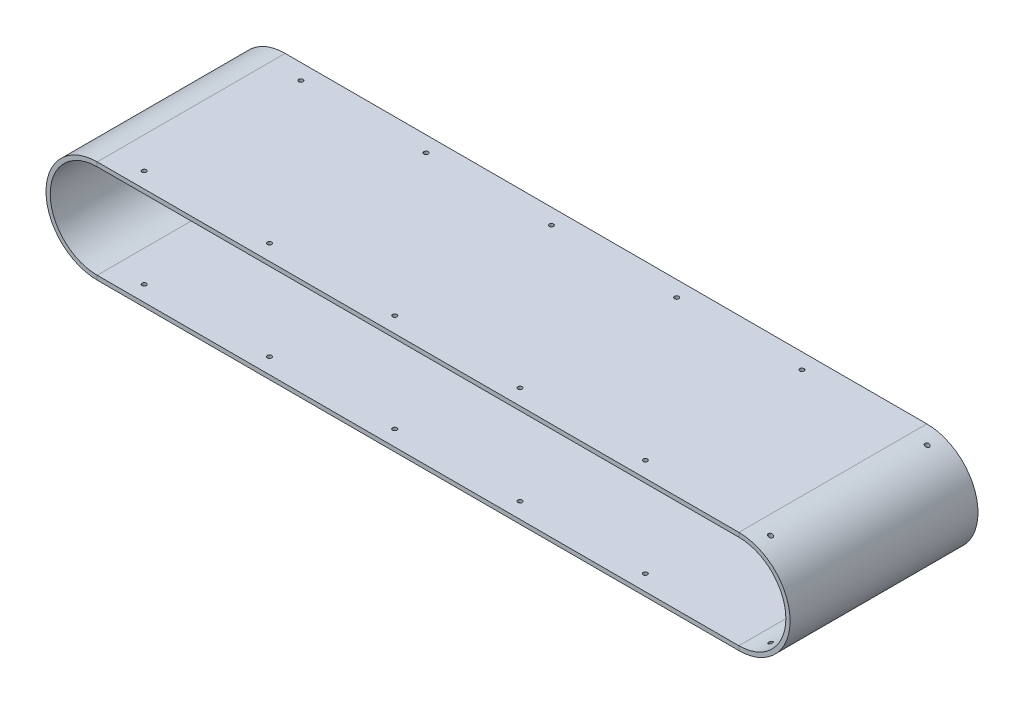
ISO-10303-21;
HEADER;
FILE_DESCRIPTION(('STEP AP214'),'2;1');
FILE_NAME('part.step','',(''),(''),'','','');
FILE_SCHEMA(('AUTOMOTIVE_DESIGN { 1 0 10303 214 1 1 1 1 }'));
ENDSEC;
DATA;
#1=APPLICATION_CONTEXT('core data for automotive mechanical design processes');
#2=APPLICATION_PROTOCOL_DEFINITION('international standard','automotive_design',2000,#1);
#3=PRODUCT_CONTEXT('',#1,'mechanical');
#4=PRODUCT('Part','Part','',(#3));
#5=PRODUCT_RELATED_PRODUCT_CATEGORY('part','',(#4));
#6=PRODUCT_DEFINITION_FORMATION('','',#4);
#7=PRODUCT_DEFINITION_CONTEXT('part definition',#1,'design');
#8=PRODUCT_DEFINITION('design','',#6,#7);
#9=PRODUCT_DEFINITION_SHAPE('','',#8);
#10=(LENGTH_UNIT() NAMED_UNIT(*) SI_UNIT(.MILLI.,.METRE.));
#11=(NAMED_UNIT(*) PLANE_ANGLE_UNIT() SI_UNIT($,.RADIAN.));
#12=(NAMED_UNIT(*) SI_UNIT($,.STERADIAN.) SOLID_ANGLE_UNIT());
#13=UNCERTAINTY_MEASURE_WITH_UNIT(LENGTH_MEASURE(1.E-05),#10,'distance_accuracy_value','');
#14=(GEOMETRIC_REPRESENTATION_CONTEXT(3) GLOBAL_UNCERTAINTY_ASSIGNED_CONTEXT((#13)) GLOBAL_UNIT_ASSIGNED_CONTEXT((#10,
#11,#12)) REPRESENTATION_CONTEXT('',''));
#15=CARTESIAN_POINT('',(0.,0.,0.));
#16=DIRECTION('',(0.,0.,1.));
#17=DIRECTION('',(1.,0.,0.));
#18=AXIS2_PLACEMENT_3D('',#15,#16,#17);
#19=CARTESIAN_POINT('',(520.371,38.1000000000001,-76.2));
#20=DIRECTION('',(0.,0.,1.));
#21=DIRECTION('',(1.,0.,0.));
#22=AXIS2_PLACEMENT_3D('',#19,#20,#21);
#23=PLANE('',#22);
#24=DIRECTION('',(0.,1.,0.));
#25=VECTOR('',#24,1.);
#26=CARTESIAN_POINT('',(520.371,38.1000000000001,-76.2));
#27=LINE('',#26,#25);
#28=CARTESIAN_POINT('',(520.371,38.1000000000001,-76.2));
#29=VERTEX_POINT('',#28);
#30=CARTESIAN_POINT('',(520.371,41.5290000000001,-76.2));
#31=VERTEX_POINT('',#30);
#32=EDGE_CURVE('E156',#29,#31,#27,.T.);
#33=ORIENTED_EDGE('',*,*,#32,.F.);
#34=DIRECTION('',(-1.,0.,0.));
#35=VECTOR('',#34,1.);
#36=CARTESIAN_POINT('',(520.371,38.1000000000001,-76.2));
#37=LINE('',#36,#35);
#38=CARTESIAN_POINT('',(0.,38.1,-76.2));
#39=VERTEX_POINT('',#38);
#40=EDGE_CURVE('E155',#29,#39,#37,.T.);
#41=ORIENTED_EDGE('',*,*,#40,.T.);
#42=DIRECTION('',(0.,1.,0.));
#43=VECTOR('',#42,1.);
#44=CARTESIAN_POINT('',(0.,38.1,-76.2));
#45=LINE('',#44,#43);
#46=CARTESIAN_POINT('',(0.,41.529,-76.2));
#47=VERTEX_POINT('',#46);
#48=EDGE_CURVE('E133',#39,#47,#45,.T.);
#49=ORIENTED_EDGE('',*,*,#48,.T.);
#50=DIRECTION('',(-1.,0.,0.));
#51=VECTOR('',#50,1.);
#52=CARTESIAN_POINT('',(520.371,41.5290000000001,-76.2));
#53=LINE('',#52,#51);
#54=EDGE_CURVE('E160',#31,#47,#53,.T.);
#55=ORIENTED_EDGE('',*,*,#54,.F.);
#56=EDGE_LOOP('',(#33,#41,#49,#55));
#57=FACE_BOUND('',#56,.T.);
#58=ADVANCED_FACE('F35',(#57),#23,.F.);
#59=CARTESIAN_POINT('',(0.,38.1,-76.2));
#60=DIRECTION('',(0.,0.,1.));
#61=DIRECTION('',(1.,0.,0.));
#62=AXIS2_PLACEMENT_3D('',#59,#60,#61);
#63=PLANE('',#62);
#64=CARTESIAN_POINT('',(0.,0.,-76.2));
#65=DIRECTION('',(0.,0.,1.));
#66=DIRECTION('',(0.,1.,0.));
#67=AXIS2_PLACEMENT_3D('',#64,#65,#66);
#68=CIRCLE('',#67,41.529);
#69=CARTESIAN_POINT('',(0.,-41.529,-76.2));
#70=VERTEX_POINT('',#69);
#71=EDGE_CURVE('E123',#47,#70,#68,.T.);
#72=ORIENTED_EDGE('',*,*,#71,.F.);
#73=ORIENTED_EDGE('',*,*,#48,.F.);
#74=CARTESIAN_POINT('',(0.,0.,-76.2));
#75=DIRECTION('',(0.,0.,1.));
#76=DIRECTION('',(0.,1.,0.));
#77=AXIS2_PLACEMENT_3D('',#74,#75,#76);
#78=CIRCLE('',#77,38.1);
#79=CARTESIAN_POINT('',(0.,-38.1,-76.2));
#80=VERTEX_POINT('',#79);
#81=EDGE_CURVE('E136',#39,#80,#78,.T.);
#82=ORIENTED_EDGE('',*,*,#81,.T.);
#83=DIRECTION('',(0.,-1.,0.));
#84=VECTOR('',#83,1.);
#85=CARTESIAN_POINT('',(0.,-38.1,-76.2));
#86=LINE('',#85,#84);
#87=EDGE_CURVE('E152',#80,#70,#86,.T.);
#88=ORIENTED_EDGE('',*,*,#87,.T.);
#89=EDGE_LOOP('',(#72,#73,#82,#88));
#90=FACE_BOUND('',#89,.T.);
#91=ADVANCED_FACE('F135',(#90),#63,.F.);
#92=CARTESIAN_POINT('',(0.,0.,0.));
#93=DIRECTION('',(0.,0.,1.));
#94=DIRECTION('',(1.,0.,0.));
#95=AXIS2_PLACEMENT_3D('',#92,#93,#94);
#96=CYLINDRICAL_SURFACE('',#95,41.529);
#97=CARTESIAN_POINT('',(0.,0.,76.2));
#98=DIRECTION('',(0.,0.,1.));
#99=DIRECTION('',(0.,1.,0.));
#100=AXIS2_PLACEMENT_3D('',#97,#98,#99);
#101=CIRCLE('',#100,41.529);
#102=CARTESIAN_POINT('',(0.,41.529,76.2));
#103=VERTEX_POINT('',#102);
#104=CARTESIAN_POINT('',(0.,-41.529,76.2));
#105=VERTEX_POINT('',#104);
#106=EDGE_CURVE('E117',#103,#105,#101,.T.);
#107=ORIENTED_EDGE('',*,*,#106,.F.);
#108=DIRECTION('',(0.,0.,1.));
#109=VECTOR('',#108,1.);
#110=CARTESIAN_POINT('',(0.,41.529,76.2));
#111=LINE('',#110,#109);
#112=EDGE_CURVE('E141',#47,#103,#111,.T.);
#113=ORIENTED_EDGE('',*,*,#112,.F.);
#114=ORIENTED_EDGE('',*,*,#71,.T.);
#115=DIRECTION('',(0.,0.,1.));
#116=VECTOR('',#115,1.);
#117=CARTESIAN_POINT('',(0.,-41.529,76.2));
#118=LINE('',#117,#116);
#119=EDGE_CURVE('E330',#70,#105,#118,.T.);
#120=ORIENTED_EDGE('',*,*,#119,.T.);
#121=EDGE_LOOP('',(#107,#113,#114,#120));
#122=FACE_BOUND('',#121,.T.);
#123=ADVANCED_FACE('F354',(#122),#96,.T.);
#124=CARTESIAN_POINT('',(0.,38.1,76.2));
#125=DIRECTION('',(0.,0.,-1.));
#126=DIRECTION('',(-1.,0.,0.));
#127=AXIS2_PLACEMENT_3D('',#124,#125,#126);
#128=PLANE('',#127);
#129=CARTESIAN_POINT('',(0.,0.,76.2));
#130=DIRECTION('',(0.,0.,1.));
#131=DIRECTION('',(0.,1.,0.));
#132=AXIS2_PLACEMENT_3D('',#129,#130,#131);
#133=CIRCLE('',#132,38.1);
#134=CARTESIAN_POINT('',(0.,38.1,76.2));
#135=VERTEX_POINT('',#134);
#136=CARTESIAN_POINT('',(0.,-38.1,76.2));
#137=VERTEX_POINT('',#136);
#138=EDGE_CURVE('E172',#135,#137,#133,.T.);
#139=ORIENTED_EDGE('',*,*,#138,.F.);
#140=DIRECTION('',(0.,-1.,0.));
#141=VECTOR('',#140,1.);
#142=CARTESIAN_POINT('',(0.,38.1,76.2));
#143=LINE('',#142,#141);
#144=EDGE_CURVE('E164',#103,#135,#143,.T.);
#145=ORIENTED_EDGE('',*,*,#144,.F.);
#146=ORIENTED_EDGE('',*,*,#106,.T.);
#147=DIRECTION('',(0.,1.,0.));
#148=VECTOR('',#147,1.);
#149=CARTESIAN_POINT('',(0.,-38.1,76.2));
#150=LINE('',#149,#148);
#151=EDGE_CURVE('E329',#105,#137,#150,.T.);
#152=ORIENTED_EDGE('',*,*,#151,.T.);
#153=EDGE_LOOP('',(#139,#145,#146,#152));
#154=FACE_BOUND('',#153,.T.);
#155=ADVANCED_FACE('F328',(#154),#128,.F.);
#156=CARTESIAN_POINT('',(0.,0.,0.));
#157=DIRECTION('',(0.,0.,1.));
#158=DIRECTION('',(1.,0.,0.));
#159=AXIS2_PLACEMENT_3D('',#156,#157,#158);
#160=CYLINDRICAL_SURFACE('',#159,38.1);
#161=DIRECTION('',(0.,0.,-1.));
#162=VECTOR('',#161,1.);
#163=CARTESIAN_POINT('',(0.,-38.1,76.2));
#164=LINE('',#163,#162);
#165=EDGE_CURVE('E150',#137,#80,#164,.T.);
#166=ORIENTED_EDGE('',*,*,#165,.T.);
#167=ORIENTED_EDGE('',*,*,#81,.F.);
#168=DIRECTION('',(0.,0.,-1.));
#169=VECTOR('',#168,1.);
#170=CARTESIAN_POINT('',(0.,38.1,76.2));
#171=LINE('',#170,#169);
#172=EDGE_CURVE('E149',#135,#39,#171,.T.);
#173=ORIENTED_EDGE('',*,*,#172,.F.);
#174=ORIENTED_EDGE('',*,*,#138,.T.);
#175=EDGE_LOOP('',(#166,#167,#173,#174));
#176=FACE_BOUND('',#175,.T.);
#177=ADVANCED_FACE('F147',(#176),#160,.F.);
#178=CARTESIAN_POINT('',(0.,-38.1,-76.2));
#179=DIRECTION('',(0.,0.,1.));
#180=DIRECTION('',(1.,0.,0.));
#181=AXIS2_PLACEMENT_3D('',#178,#179,#180);
#182=PLANE('',#181);
#183=DIRECTION('',(1.,0.,0.));
#184=VECTOR('',#183,1.);
#185=CARTESIAN_POINT('',(0.,-41.529,-76.2));
#186=LINE('',#185,#184);
#187=CARTESIAN_POINT('',(520.371,-41.5290000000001,-76.2));
#188=VERTEX_POINT('',#187);
#189=EDGE_CURVE('E104',#70,#188,#186,.T.);
#190=ORIENTED_EDGE('',*,*,#189,.F.);
#191=ORIENTED_EDGE('',*,*,#87,.F.);
#192=DIRECTION('',(1.,0.,0.));
#193=VECTOR('',#192,1.);
#194=CARTESIAN_POINT('',(0.,-38.1,-76.2));
#195=LINE('',#194,#193);
#196=CARTESIAN_POINT('',(520.371,-38.1000000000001,-76.2));
#197=VERTEX_POINT('',#196);
#198=EDGE_CURVE('E171',#80,#197,#195,.T.);
#199=ORIENTED_EDGE('',*,*,#198,.T.);
#200=DIRECTION('',(0.,-1.,0.));
#201=VECTOR('',#200,1.);
#202=CARTESIAN_POINT('',(520.371,-38.1000000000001,-76.2));
#203=LINE('',#202,#201);
#204=EDGE_CURVE('E346',#197,#188,#203,.T.);
#205=ORIENTED_EDGE('',*,*,#204,.T.);
#206=EDGE_LOOP('',(#190,#191,#199,#205));
#207=FACE_BOUND('',#206,.T.);
#208=ADVANCED_FACE('F351',(#207),#182,.F.);
#209=CARTESIAN_POINT('',(0.,-41.529,76.2));
#210=DIRECTION('',(0.,1.,0.));
#211=DIRECTION('',(-1.,0.,0.));
#212=AXIS2_PLACEMENT_3D('',#209,#210,#211);
#213=PLANE('',#212);
#214=CARTESIAN_POINT('',(228.6,-41.5290000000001,-63.5));
#215=DIRECTION('',(0.,1.,0.));
#216=DIRECTION('',(1.,0.,0.));
#217=AXIS2_PLACEMENT_3D('',#214,#215,#216);
#218=CIRCLE('',#217,1.75000000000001);
#219=CARTESIAN_POINT('',(230.35,-41.5290000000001,-63.5));
#220=VERTEX_POINT('',#219);
#221=EDGE_CURVE('E455',#220,#220,#218,.T.);
#222=ORIENTED_EDGE('',*,*,#221,.T.);
#223=EDGE_LOOP('',(#222));
#224=FACE_BOUND('',#223,.T.);
#225=CARTESIAN_POINT('',(330.2,-41.5290000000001,63.4999999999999));
#226=DIRECTION('',(0.,1.,0.));
#227=DIRECTION('',(-1.,0.,0.));
#228=AXIS2_PLACEMENT_3D('',#225,#226,#227);
#229=CIRCLE('',#228,1.75000000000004);
#230=CARTESIAN_POINT('',(328.45,-41.5290000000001,63.4999999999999));
#231=VERTEX_POINT('',#230);
#232=EDGE_CURVE('E466',#231,#231,#229,.T.);
#233=ORIENTED_EDGE('',*,*,#232,.T.);
#234=EDGE_LOOP('',(#233));
#235=FACE_BOUND('',#234,.T.);
#236=CARTESIAN_POINT('',(330.2,-41.5290000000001,-63.5));
#237=DIRECTION('',(0.,1.,0.));
#238=DIRECTION('',(1.,0.,0.));
#239=AXIS2_PLACEMENT_3D('',#236,#237,#238);
#240=CIRCLE('',#239,1.74999999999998);
#241=CARTESIAN_POINT('',(331.95,-41.5290000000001,-63.5));
#242=VERTEX_POINT('',#241);
#243=EDGE_CURVE('E467',#242,#242,#240,.T.);
#244=ORIENTED_EDGE('',*,*,#243,.T.);
#245=EDGE_LOOP('',(#244));
#246=FACE_BOUND('',#245,.T.);
#247=CARTESIAN_POINT('',(431.8,-41.5290000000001,63.4999999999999));
#248=DIRECTION('',(0.,1.,0.));
#249=DIRECTION('',(-1.,0.,0.));
#250=AXIS2_PLACEMENT_3D('',#247,#248,#249);
#251=CIRCLE('',#250,1.75000000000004);
#252=CARTESIAN_POINT('',(430.05,-41.5290000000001,63.4999999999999));
#253=VERTEX_POINT('',#252);
#254=EDGE_CURVE('E478',#253,#253,#251,.T.);
#255=ORIENTED_EDGE('',*,*,#254,.T.);
#256=EDGE_LOOP('',(#255));
#257=FACE_BOUND('',#256,.T.);
#258=CARTESIAN_POINT('',(25.4,-41.5290000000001,-63.5));
#259=DIRECTION('',(0.,1.,0.));
#260=DIRECTION('',(1.,0.,0.));
#261=AXIS2_PLACEMENT_3D('',#258,#259,#260);
#262=CIRCLE('',#261,1.75);
#263=CARTESIAN_POINT('',(27.15,-41.5290000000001,-63.5));
#264=VERTEX_POINT('',#263);
#265=EDGE_CURVE('E436',#264,#264,#262,.T.);
#266=ORIENTED_EDGE('',*,*,#265,.T.);
#267=EDGE_LOOP('',(#266));
#268=FACE_BOUND('',#267,.T.);
#269=CARTESIAN_POINT('',(127.,-41.5290000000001,63.5));
#270=DIRECTION('',(0.,1.,0.));
#271=DIRECTION('',(-1.,0.,0.));
#272=AXIS2_PLACEMENT_3D('',#269,#270,#271);
#273=CIRCLE('',#272,1.75000000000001);
#274=CARTESIAN_POINT('',(125.25,-41.5290000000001,63.5));
#275=VERTEX_POINT('',#274);
#276=EDGE_CURVE('E442',#275,#275,#273,.T.);
#277=ORIENTED_EDGE('',*,*,#276,.T.);
#278=EDGE_LOOP('',(#277));
#279=FACE_BOUND('',#278,.T.);
#280=CARTESIAN_POINT('',(127.,-41.5290000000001,-63.5));
#281=DIRECTION('',(0.,1.,0.));
#282=DIRECTION('',(1.,0.,0.));
#283=AXIS2_PLACEMENT_3D('',#280,#281,#282);
#284=CIRCLE('',#283,1.75000000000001);
#285=CARTESIAN_POINT('',(128.75,-41.5290000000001,-63.5));
#286=VERTEX_POINT('',#285);
#287=EDGE_CURVE('E443',#286,#286,#284,.T.);
#288=ORIENTED_EDGE('',*,*,#287,.T.);
#289=EDGE_LOOP('',(#288));
#290=FACE_BOUND('',#289,.T.);
#291=CARTESIAN_POINT('',(228.6,-41.5290000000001,63.5));
#292=DIRECTION('',(0.,1.,0.));
#293=DIRECTION('',(-1.,0.,0.));
#294=AXIS2_PLACEMENT_3D('',#291,#292,#293);
#295=CIRCLE('',#294,1.74999999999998);
#296=CARTESIAN_POINT('',(226.85,-41.5290000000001,63.5));
#297=VERTEX_POINT('',#296);
#298=EDGE_CURVE('E454',#297,#297,#295,.T.);
#299=ORIENTED_EDGE('',*,*,#298,.T.);
#300=EDGE_LOOP('',(#299));
#301=FACE_BOUND('',#300,.T.);
#302=CARTESIAN_POINT('',(431.8,-41.5290000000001,-63.5));
#303=DIRECTION('',(0.,1.,0.));
#304=DIRECTION('',(1.,0.,0.));
#305=AXIS2_PLACEMENT_3D('',#302,#303,#304);
#306=CIRCLE('',#305,1.74999999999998);
#307=CARTESIAN_POINT('',(433.55,-41.5290000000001,-63.5));
#308=VERTEX_POINT('',#307);
#309=EDGE_CURVE('E479',#308,#308,#306,.T.);
#310=ORIENTED_EDGE('',*,*,#309,.T.);
#311=EDGE_LOOP('',(#310));
#312=FACE_BOUND('',#311,.T.);
#313=CARTESIAN_POINT('',(25.4,-41.5290000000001,63.5));
#314=DIRECTION('',(0.,1.,0.));
#315=DIRECTION('',(-1.,0.,0.));
#316=AXIS2_PLACEMENT_3D('',#313,#314,#315);
#317=CIRCLE('',#316,1.75);
#318=CARTESIAN_POINT('',(23.65,-41.5290000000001,63.5));
#319=VERTEX_POINT('',#318);
#320=EDGE_CURVE('E181',#319,#319,#317,.T.);
#321=ORIENTED_EDGE('',*,*,#320,.T.);
#322=EDGE_LOOP('',(#321));
#323=FACE_BOUND('',#322,.T.);
#324=DIRECTION('',(1.,0.,0.));
#325=VECTOR('',#324,1.);
#326=CARTESIAN_POINT('',(0.,-41.529,76.2));
#327=LINE('',#326,#325);
#328=CARTESIAN_POINT('',(520.371,-41.5290000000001,76.2));
#329=VERTEX_POINT('',#328);
#330=EDGE_CURVE('E97',#105,#329,#327,.T.);
#331=ORIENTED_EDGE('',*,*,#330,.F.);
#332=ORIENTED_EDGE('',*,*,#119,.F.);
#333=ORIENTED_EDGE('',*,*,#189,.T.);
#334=DIRECTION('',(0.,0.,1.));
#335=VECTOR('',#334,1.);
#336=CARTESIAN_POINT('',(520.371,-41.5290000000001,76.2));
#337=LINE('',#336,#335);
#338=EDGE_CURVE('E310',#188,#329,#337,.T.);
#339=ORIENTED_EDGE('',*,*,#338,.T.);
#340=EDGE_LOOP('',(#331,#332,#333,#339));
#341=FACE_BOUND('',#340,.T.);
#342=ADVANCED_FACE('F269',(#224,#235,#246,#257,#268,#279,#290,#301,#312,#323,#341),#213,.F.);
#343=CARTESIAN_POINT('',(0.,-38.1,76.2));
#344=DIRECTION('',(0.,0.,-1.));
#345=DIRECTION('',(-1.,0.,0.));
#346=AXIS2_PLACEMENT_3D('',#343,#344,#345);
#347=PLANE('',#346);
#348=DIRECTION('',(1.,0.,0.));
#349=VECTOR('',#348,1.);
#350=CARTESIAN_POINT('',(0.,-38.1,76.2));
#351=LINE('',#350,#349);
#352=CARTESIAN_POINT('',(520.371,-38.1000000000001,76.2));
#353=VERTEX_POINT('',#352);
#354=EDGE_CURVE('E88',#137,#353,#351,.T.);
#355=ORIENTED_EDGE('',*,*,#354,.F.);
#356=ORIENTED_EDGE('',*,*,#151,.F.);
#357=ORIENTED_EDGE('',*,*,#330,.T.);
#358=DIRECTION('',(0.,1.,0.));
#359=VECTOR('',#358,1.);
#360=CARTESIAN_POINT('',(520.371,-38.1000000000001,76.2));
#361=LINE('',#360,#359);
#362=EDGE_CURVE('E316',#329,#353,#361,.T.);
#363=ORIENTED_EDGE('',*,*,#362,.T.);
#364=EDGE_LOOP('',(#355,#356,#357,#363));
#365=FACE_BOUND('',#364,.T.);
#366=ADVANCED_FACE('F383',(#365),#347,.F.);
#367=CARTESIAN_POINT('',(0.,-38.1,76.2));
#368=DIRECTION('',(0.,-1.,0.));
#369=DIRECTION('',(1.,0.,0.));
#370=AXIS2_PLACEMENT_3D('',#367,#368,#369);
#371=PLANE('',#370);
#372=CARTESIAN_POINT('',(228.6,-38.1,-63.5));
#373=DIRECTION('',(0.,-1.,0.));
#374=DIRECTION('',(1.,0.,0.));
#375=AXIS2_PLACEMENT_3D('',#372,#373,#374);
#376=CIRCLE('',#375,1.75000000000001);
#377=CARTESIAN_POINT('',(230.35,-38.1,-63.5));
#378=VERTEX_POINT('',#377);
#379=EDGE_CURVE('E217',#378,#378,#376,.T.);
#380=ORIENTED_EDGE('',*,*,#379,.T.);
#381=EDGE_LOOP('',(#380));
#382=FACE_BOUND('',#381,.T.);
#383=CARTESIAN_POINT('',(330.2,-38.1,63.4999999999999));
#384=DIRECTION('',(0.,-1.,0.));
#385=DIRECTION('',(1.,0.,0.));
#386=AXIS2_PLACEMENT_3D('',#383,#384,#385);
#387=CIRCLE('',#386,1.75000000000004);
#388=CARTESIAN_POINT('',(331.95,-38.1,63.4999999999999));
#389=VERTEX_POINT('',#388);
#390=EDGE_CURVE('E213',#389,#389,#387,.T.);
#391=ORIENTED_EDGE('',*,*,#390,.T.);
#392=EDGE_LOOP('',(#391));
#393=FACE_BOUND('',#392,.T.);
#394=CARTESIAN_POINT('',(330.2,-38.1,-63.5));
#395=DIRECTION('',(0.,-1.,0.));
#396=DIRECTION('',(1.,0.,0.));
#397=AXIS2_PLACEMENT_3D('',#394,#395,#396);
#398=CIRCLE('',#397,1.74999999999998);
#399=CARTESIAN_POINT('',(331.95,-38.1,-63.5));
#400=VERTEX_POINT('',#399);
#401=EDGE_CURVE('E209',#400,#400,#398,.T.);
#402=ORIENTED_EDGE('',*,*,#401,.T.);
#403=EDGE_LOOP('',(#402));
#404=FACE_BOUND('',#403,.T.);
#405=CARTESIAN_POINT('',(431.8,-38.1,63.4999999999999));
#406=DIRECTION('',(0.,-1.,0.));
#407=DIRECTION('',(1.,0.,0.));
#408=AXIS2_PLACEMENT_3D('',#405,#406,#407);
#409=CIRCLE('',#408,1.75000000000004);
#410=CARTESIAN_POINT('',(433.55,-38.1,63.4999999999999));
#411=VERTEX_POINT('',#410);
#412=EDGE_CURVE('E205',#411,#411,#409,.T.);
#413=ORIENTED_EDGE('',*,*,#412,.T.);
#414=EDGE_LOOP('',(#413));
#415=FACE_BOUND('',#414,.T.);
#416=CARTESIAN_POINT('',(25.4,-38.1,-63.5));
#417=DIRECTION('',(0.,-1.,0.));
#418=DIRECTION('',(1.,0.,0.));
#419=AXIS2_PLACEMENT_3D('',#416,#417,#418);
#420=CIRCLE('',#419,1.75);
#421=CARTESIAN_POINT('',(27.15,-38.1,-63.5));
#422=VERTEX_POINT('',#421);
#423=EDGE_CURVE('E201',#422,#422,#420,.T.);
#424=ORIENTED_EDGE('',*,*,#423,.T.);
#425=EDGE_LOOP('',(#424));
#426=FACE_BOUND('',#425,.T.);
#427=CARTESIAN_POINT('',(127.,-38.1,63.5));
#428=DIRECTION('',(0.,-1.,0.));
#429=DIRECTION('',(1.,0.,0.));
#430=AXIS2_PLACEMENT_3D('',#427,#428,#429);
#431=CIRCLE('',#430,1.75000000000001);
#432=CARTESIAN_POINT('',(128.75,-38.1,63.5));
#433=VERTEX_POINT('',#432);
#434=EDGE_CURVE('E197',#433,#433,#431,.T.);
#435=ORIENTED_EDGE('',*,*,#434,.T.);
#436=EDGE_LOOP('',(#435));
#437=FACE_BOUND('',#436,.T.);
#438=CARTESIAN_POINT('',(127.,-38.1,-63.5));
#439=DIRECTION('',(0.,-1.,0.));
#440=DIRECTION('',(1.,0.,0.));
#441=AXIS2_PLACEMENT_3D('',#438,#439,#440);
#442=CIRCLE('',#441,1.75000000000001);
#443=CARTESIAN_POINT('',(128.75,-38.1,-63.5));
#444=VERTEX_POINT('',#443);
#445=EDGE_CURVE('E193',#444,#444,#442,.T.);
#446=ORIENTED_EDGE('',*,*,#445,.T.);
#447=EDGE_LOOP('',(#446));
#448=FACE_BOUND('',#447,.T.);
#449=CARTESIAN_POINT('',(228.6,-38.1,63.5));
#450=DIRECTION('',(0.,-1.,0.));
#451=DIRECTION('',(1.,0.,0.));
#452=AXIS2_PLACEMENT_3D('',#449,#450,#451);
#453=CIRCLE('',#452,1.74999999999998);
#454=CARTESIAN_POINT('',(230.35,-38.1,63.5));
#455=VERTEX_POINT('',#454);
#456=EDGE_CURVE('E189',#455,#455,#453,.T.);
#457=ORIENTED_EDGE('',*,*,#456,.T.);
#458=EDGE_LOOP('',(#457));
#459=FACE_BOUND('',#458,.T.);
#460=CARTESIAN_POINT('',(431.8,-38.1,-63.5));
#461=DIRECTION('',(0.,-1.,0.));
#462=DIRECTION('',(1.,0.,0.));
#463=AXIS2_PLACEMENT_3D('',#460,#461,#462);
#464=CIRCLE('',#463,1.74999999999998);
#465=CARTESIAN_POINT('',(433.55,-38.1,-63.5));
#466=VERTEX_POINT('',#465);
#467=EDGE_CURVE('E185',#466,#466,#464,.T.);
#468=ORIENTED_EDGE('',*,*,#467,.T.);
#469=EDGE_LOOP('',(#468));
#470=FACE_BOUND('',#469,.T.);
#471=CARTESIAN_POINT('',(25.4,-38.1,63.5));
#472=DIRECTION('',(0.,-1.,0.));
#473=DIRECTION('',(1.,0.,0.));
#474=AXIS2_PLACEMENT_3D('',#471,#472,#473);
#475=CIRCLE('',#474,1.75);
#476=CARTESIAN_POINT('',(27.15,-38.1,63.5));
#477=VERTEX_POINT('',#476);
#478=EDGE_CURVE('E180',#477,#477,#475,.T.);
#479=ORIENTED_EDGE('',*,*,#478,.T.);
#480=EDGE_LOOP('',(#479));
#481=FACE_BOUND('',#480,.T.);
#482=DIRECTION('',(0.,0.,-1.));
#483=VECTOR('',#482,1.);
#484=CARTESIAN_POINT('',(520.371,-38.1000000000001,76.2));
#485=LINE('',#484,#483);
#486=EDGE_CURVE('E173',#353,#197,#485,.T.);
#487=ORIENTED_EDGE('',*,*,#486,.T.);
#488=ORIENTED_EDGE('',*,*,#198,.F.);
#489=ORIENTED_EDGE('',*,*,#165,.F.);
#490=ORIENTED_EDGE('',*,*,#354,.T.);
#491=EDGE_LOOP('',(#487,#488,#489,#490));
#492=FACE_BOUND('',#491,.T.);
#493=ADVANCED_FACE('F386',(#382,#393,#404,#415,#426,#437,#448,#459,#470,#481,#492),#371,.F.);
#494=CARTESIAN_POINT('',(520.371,-38.1,-76.2));
#495=DIRECTION('',(0.,0.,1.));
#496=DIRECTION('',(1.,0.,0.));
#497=AXIS2_PLACEMENT_3D('',#494,#495,#496);
#498=PLANE('',#497);
#499=CARTESIAN_POINT('',(520.371,0.,-76.2));
#500=DIRECTION('',(0.,0.,1.));
#501=DIRECTION('',(0.,-1.,0.));
#502=AXIS2_PLACEMENT_3D('',#499,#500,#501);
#503=CIRCLE('',#502,41.5290000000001);
#504=EDGE_CURVE('E334',#188,#31,#503,.T.);
#505=ORIENTED_EDGE('',*,*,#504,.F.);
#506=ORIENTED_EDGE('',*,*,#204,.F.);
#507=CARTESIAN_POINT('',(520.371,0.,-76.2));
#508=DIRECTION('',(0.,0.,1.));
#509=DIRECTION('',(0.,-1.,0.));
#510=AXIS2_PLACEMENT_3D('',#507,#508,#509);
#511=CIRCLE('',#510,38.1000000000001);
#512=EDGE_CURVE('E175',#197,#29,#511,.T.);
#513=ORIENTED_EDGE('',*,*,#512,.T.);
#514=ORIENTED_EDGE('',*,*,#32,.T.);
#515=EDGE_LOOP('',(#505,#506,#513,#514));
#516=FACE_BOUND('',#515,.T.);
#517=ADVANCED_FACE('F267',(#516),#498,.F.);
#518=CARTESIAN_POINT('',(520.371,0.,0.));
#519=DIRECTION('',(0.,0.,1.));
#520=DIRECTION('',(1.,0.,0.));
#521=AXIS2_PLACEMENT_3D('',#518,#519,#520);
#522=CYLINDRICAL_SURFACE('',#521,41.5290000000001);
#523=CARTESIAN_POINT('',(531.65,-39.968012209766,-63.5));
#524=CARTESIAN_POINT('',(531.650004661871,-39.9680112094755,-63.4045553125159));
#525=CARTESIAN_POINT('',(531.657839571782,-39.9658024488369,-63.3090385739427));
#526=CARTESIAN_POINT('',(531.688933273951,-39.9570078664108,-63.1206788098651));
#527=CARTESIAN_POINT('',(531.712211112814,-39.9504166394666,-63.0278392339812));
#528=CARTESIAN_POINT('',(531.773358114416,-39.9330073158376,-62.8476392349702));
#529=CARTESIAN_POINT('',(531.811210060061,-39.9221942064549,-62.7602724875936));
#530=CARTESIAN_POINT('',(531.900224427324,-39.8965782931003,-62.5932879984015));
#531=CARTESIAN_POINT('',(531.951384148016,-39.8817762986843,-62.5136686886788));
#532=CARTESIAN_POINT('',(532.0662102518,-39.8482561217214,-62.3630741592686));
#533=CARTESIAN_POINT('',(532.130047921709,-39.829484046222,-62.2922417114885));
#534=CARTESIAN_POINT('',(532.267757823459,-39.7885680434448,-62.1622794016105));
#535=CARTESIAN_POINT('',(532.34163183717,-39.7664235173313,-62.1031516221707));
#536=CARTESIAN_POINT('',(532.500066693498,-39.7183920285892,-61.9959749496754));
#537=CARTESIAN_POINT('',(532.584916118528,-39.6923991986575,-61.9484003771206));
#538=CARTESIAN_POINT('',(532.76062424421,-39.6379050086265,-61.8681192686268));
#539=CARTESIAN_POINT('',(532.851484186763,-39.6094031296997,-61.8354158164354));
#540=CARTESIAN_POINT('',(533.040726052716,-39.5492875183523,-61.7843572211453));
#541=CARTESIAN_POINT('',(533.139263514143,-39.517592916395,-61.7666733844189));
#542=CARTESIAN_POINT('',(533.337518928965,-39.4529860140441,-61.7482827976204));
#543=CARTESIAN_POINT('',(533.437237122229,-39.4200734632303,-61.7475795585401));
#544=CARTESIAN_POINT('',(533.63864676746,-39.352751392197,-61.7633088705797));
#545=CARTESIAN_POINT('',(533.740288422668,-39.3183292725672,-61.7803305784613));
#546=CARTESIAN_POINT('',(533.939235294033,-39.2501197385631,-61.8319802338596));
#547=CARTESIAN_POINT('',(534.036539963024,-39.2163324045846,-61.866610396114));
#548=CARTESIAN_POINT('',(534.224740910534,-39.150245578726,-61.9530344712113));
#549=CARTESIAN_POINT('',(534.315584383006,-39.1179589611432,-62.0049536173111));
#550=CARTESIAN_POINT('',(534.487237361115,-39.0563440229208,-62.1247319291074));
#551=CARTESIAN_POINT('',(534.568048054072,-39.0270153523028,-62.1925892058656));
#552=CARTESIAN_POINT('',(534.714483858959,-38.973429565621,-62.3402167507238));
#553=CARTESIAN_POINT('',(534.78050858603,-38.9490413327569,-62.4195420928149));
#554=CARTESIAN_POINT('',(534.89806902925,-38.9053473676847,-62.589530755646));
#555=CARTESIAN_POINT('',(534.949610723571,-38.8860395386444,-62.6801893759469));
#556=CARTESIAN_POINT('',(535.033422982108,-38.8545117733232,-62.8643601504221));
#557=CARTESIAN_POINT('',(535.066673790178,-38.8419325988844,-62.9573646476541));
#558=CARTESIAN_POINT('',(535.117113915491,-38.822811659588,-63.1482189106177));
#559=CARTESIAN_POINT('',(535.134309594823,-38.8162675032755,-63.2460667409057));
#560=CARTESIAN_POINT('',(535.151406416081,-38.8097604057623,-63.4380009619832));
#561=CARTESIAN_POINT('',(535.152210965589,-38.8094536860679,-63.531996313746));
#562=CARTESIAN_POINT('',(535.138796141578,-38.8145602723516,-63.7187413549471));
#563=CARTESIAN_POINT('',(535.124578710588,-38.8199728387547,-63.811491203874));
#564=CARTESIAN_POINT('',(535.082030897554,-38.8361160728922,-63.9916358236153));
#565=CARTESIAN_POINT('',(535.053926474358,-38.8467615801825,-64.0790919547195));
#566=CARTESIAN_POINT('',(534.984745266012,-38.8728394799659,-64.2479368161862));
#567=CARTESIAN_POINT('',(534.943667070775,-38.8882723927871,-64.3293248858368));
#568=CARTESIAN_POINT('',(534.848453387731,-38.9238209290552,-64.4865008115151));
#569=CARTESIAN_POINT('',(534.793954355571,-38.944066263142,-64.5620386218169));
#570=CARTESIAN_POINT('',(534.674336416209,-38.9881580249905,-64.7029612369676));
#571=CARTESIAN_POINT('',(534.609214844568,-39.012005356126,-64.7683434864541));
#572=CARTESIAN_POINT('',(534.466115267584,-39.06394347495,-64.8911491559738));
#573=CARTESIAN_POINT('',(534.387609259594,-39.0922005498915,-64.9478869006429));
#574=CARTESIAN_POINT('',(534.222938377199,-39.1508529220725,-65.0474289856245));
#575=CARTESIAN_POINT('',(534.136771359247,-39.1812488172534,-65.0902294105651));
#576=CARTESIAN_POINT('',(533.9540200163,-39.2449904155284,-65.163059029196));
#577=CARTESIAN_POINT('',(533.857122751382,-39.2784061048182,-65.1922434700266));
#578=CARTESIAN_POINT('',(533.659861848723,-39.3455823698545,-65.2335313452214));
#579=CARTESIAN_POINT('',(533.559497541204,-39.379343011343,-65.2456314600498));
#580=CARTESIAN_POINT('',(533.355196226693,-39.44718471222,-65.2524898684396));
#581=CARTESIAN_POINT('',(533.251236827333,-39.481249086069,-65.2467625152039));
#582=CARTESIAN_POINT('',(533.045469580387,-39.5477857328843,-65.2168621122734));
#583=CARTESIAN_POINT('',(532.9436617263,-39.5802580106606,-65.1926891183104));
#584=CARTESIAN_POINT('',(532.746275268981,-39.6424142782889,-65.1266121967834));
#585=CARTESIAN_POINT('',(532.650644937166,-39.6721227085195,-65.0848863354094));
#586=CARTESIAN_POINT('',(532.467610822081,-39.7283150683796,-64.9845983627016));
#587=CARTESIAN_POINT('',(532.380205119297,-39.7547997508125,-64.9260401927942));
#588=CARTESIAN_POINT('',(532.219690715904,-39.8029288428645,-64.7960098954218));
#589=CARTESIAN_POINT('',(532.146172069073,-39.8247163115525,-64.7250971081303));
#590=CARTESIAN_POINT('',(532.012128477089,-39.8641049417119,-64.5708610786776));
#591=CARTESIAN_POINT('',(531.951603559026,-39.8817060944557,-64.4875378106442));
#592=CARTESIAN_POINT('',(531.848117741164,-39.9116072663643,-64.3147792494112));
#593=CARTESIAN_POINT('',(531.804509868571,-39.9241038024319,-64.225764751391));
#594=CARTESIAN_POINT('',(531.732882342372,-39.9445474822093,-64.0412752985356));
#595=CARTESIAN_POINT('',(531.704839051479,-39.9525015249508,-63.9458103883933));
#596=CARTESIAN_POINT('',(531.673427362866,-39.9613952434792,-63.7913340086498));
#597=CARTESIAN_POINT('',(531.664655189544,-39.9638740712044,-63.7334532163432));
#598=CARTESIAN_POINT('',(531.652940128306,-39.9671828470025,-63.6170573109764));
#599=CARTESIAN_POINT('',(531.649997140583,-39.9680128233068,-63.5585422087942));
#600=CARTESIAN_POINT('',(531.65,-39.968012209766,-63.5));
#601=B_SPLINE_CURVE_WITH_KNOTS('',3,(#523,#524,#525,#526,#527,#528,#529,#530,#531,#532,#533,
#534,#535,#536,#537,#538,#539,#540,#541,#542,#543,#544,#545,#546,#547,#548,#549,#550,#551,#552,
#553,#554,#555,#556,#557,#558,#559,#560,#561,#562,#563,#564,#565,#566,#567,#568,#569,#570,#571,
#572,#573,#574,#575,#576,#577,#578,#579,#580,#581,#582,#583,#584,#585,#586,#587,#588,#589,#590,
#591,#592,#593,#594,#595,#596,#597,#598,#599,#600),.UNSPECIFIED.,.T.,.F.,(4,2,2,2,2,2,2,2,2,2,2,
2,2,2,2,2,2,2,2,2,2,2,2,2,2,2,2,2,2,2,2,2,2,2,2,2,2,2,4),(0.,0.286116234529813,
0.572586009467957,0.85871839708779,1.14479275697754,1.43503327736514,1.72532539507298,
2.02604627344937,2.32682948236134,2.64043868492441,2.95411273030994,3.27855623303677,
3.60304055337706,3.92992835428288,4.2567774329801,4.57328364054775,4.88965901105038,
5.18682088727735,5.48386495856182,5.76449010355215,6.04507896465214,6.32124560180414,
6.59744226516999,6.88215492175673,7.16693910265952,7.46831612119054,7.76977773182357,
8.08804119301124,8.40636648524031,8.73343858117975,9.06050968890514,9.38433990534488,
9.70809435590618,10.0198444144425,10.3315951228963,10.6298488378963,10.9276483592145,
11.1031443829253,11.2786374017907),.UNSPECIFIED.);
#602=CARTESIAN_POINT('',(531.65,-39.968012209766,-63.5));
#603=VERTEX_POINT('',#602);
#604=EDGE_CURVE('E142',#603,#603,#601,.T.);
#605=ORIENTED_EDGE('',*,*,#604,.T.);
#606=EDGE_LOOP('',(#605));
#607=FACE_BOUND('',#606,.T.);
#608=CARTESIAN_POINT('',(531.65,39.9680122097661,-63.5));
#609=CARTESIAN_POINT('',(531.650004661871,39.9680112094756,-63.5954446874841));
#610=CARTESIAN_POINT('',(531.657839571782,39.965802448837,-63.6909614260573));
#611=CARTESIAN_POINT('',(531.688933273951,39.9570078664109,-63.8793211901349));
#612=CARTESIAN_POINT('',(531.712211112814,39.9504166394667,-63.9721607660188));
#613=CARTESIAN_POINT('',(531.773358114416,39.9330073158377,-64.1523607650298));
#614=CARTESIAN_POINT('',(531.811210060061,39.922194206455,-64.2397275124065));
#615=CARTESIAN_POINT('',(531.900224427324,39.8965782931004,-64.4067120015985));
#616=CARTESIAN_POINT('',(531.951384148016,39.8817762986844,-64.4863313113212));
#617=CARTESIAN_POINT('',(532.0662102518,39.8482561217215,-64.6369258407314));
#618=CARTESIAN_POINT('',(532.130047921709,39.8294840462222,-64.7077582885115));
#619=CARTESIAN_POINT('',(532.267757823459,39.7885680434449,-64.8377205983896));
#620=CARTESIAN_POINT('',(532.34163183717,39.7664235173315,-64.8968483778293));
#621=CARTESIAN_POINT('',(532.500066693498,39.7183920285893,-65.0040250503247));
#622=CARTESIAN_POINT('',(532.584916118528,39.6923991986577,-65.0515996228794));
#623=CARTESIAN_POINT('',(532.76062424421,39.6379050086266,-65.1318807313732));
#624=CARTESIAN_POINT('',(532.851484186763,39.6094031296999,-65.1645841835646));
#625=CARTESIAN_POINT('',(533.040726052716,39.5492875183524,-65.2156427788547));
#626=CARTESIAN_POINT('',(533.139263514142,39.5175929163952,-65.2333266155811));
#627=CARTESIAN_POINT('',(533.337518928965,39.4529860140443,-65.2517172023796));
#628=CARTESIAN_POINT('',(533.437237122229,39.4200734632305,-65.25242044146));
#629=CARTESIAN_POINT('',(533.63864676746,39.3527513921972,-65.2366911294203));
#630=CARTESIAN_POINT('',(533.740288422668,39.3183292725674,-65.2196694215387));
#631=CARTESIAN_POINT('',(533.939235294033,39.2501197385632,-65.1680197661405));
#632=CARTESIAN_POINT('',(534.036539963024,39.2163324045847,-65.133389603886));
#633=CARTESIAN_POINT('',(534.224740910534,39.1502455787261,-65.0469655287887));
#634=CARTESIAN_POINT('',(534.315584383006,39.1179589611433,-64.9950463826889));
#635=CARTESIAN_POINT('',(534.487237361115,39.0563440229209,-64.8752680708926));
#636=CARTESIAN_POINT('',(534.568048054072,39.0270153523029,-64.8074107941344));
#637=CARTESIAN_POINT('',(534.714483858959,38.9734295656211,-64.6597832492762));
#638=CARTESIAN_POINT('',(534.78050858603,38.9490413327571,-64.5804579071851));
#639=CARTESIAN_POINT('',(534.89806902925,38.9053473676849,-64.410469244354));
#640=CARTESIAN_POINT('',(534.949610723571,38.8860395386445,-64.3198106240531));
#641=CARTESIAN_POINT('',(535.033422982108,38.8545117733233,-64.135639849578));
#642=CARTESIAN_POINT('',(535.066673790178,38.8419325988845,-64.0426353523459));
#643=CARTESIAN_POINT('',(535.117113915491,38.8228116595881,-63.8517810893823));
#644=CARTESIAN_POINT('',(535.134309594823,38.8162675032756,-63.7539332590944));
#645=CARTESIAN_POINT('',(535.151406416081,38.8097604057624,-63.5619990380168));
#646=CARTESIAN_POINT('',(535.152210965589,38.809453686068,-63.468003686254));
#647=CARTESIAN_POINT('',(535.138796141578,38.8145602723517,-63.2812586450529));
#648=CARTESIAN_POINT('',(535.124578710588,38.8199728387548,-63.188508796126));
#649=CARTESIAN_POINT('',(535.082030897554,38.8361160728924,-63.0083641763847));
#650=CARTESIAN_POINT('',(535.053926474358,38.8467615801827,-62.9209080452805));
#651=CARTESIAN_POINT('',(534.984745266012,38.872839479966,-62.7520631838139));
#652=CARTESIAN_POINT('',(534.943667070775,38.8882723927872,-62.6706751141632));
#653=CARTESIAN_POINT('',(534.848453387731,38.9238209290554,-62.5134991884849));
#654=CARTESIAN_POINT('',(534.793954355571,38.9440662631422,-62.4379613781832));
#655=CARTESIAN_POINT('',(534.674336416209,38.9881580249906,-62.2970387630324));
#656=CARTESIAN_POINT('',(534.609214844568,39.0120053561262,-62.2316565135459));
#657=CARTESIAN_POINT('',(534.466115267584,39.0639434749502,-62.1088508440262));
#658=CARTESIAN_POINT('',(534.387609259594,39.0922005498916,-62.0521130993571));
#659=CARTESIAN_POINT('',(534.222938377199,39.1508529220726,-61.9525710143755));
#660=CARTESIAN_POINT('',(534.136771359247,39.1812488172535,-61.909770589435));
#661=CARTESIAN_POINT('',(533.9540200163,39.2449904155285,-61.8369409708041));
#662=CARTESIAN_POINT('',(533.857122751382,39.2784061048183,-61.8077565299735));
#663=CARTESIAN_POINT('',(533.659861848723,39.3455823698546,-61.7664686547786));
#664=CARTESIAN_POINT('',(533.559497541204,39.3793430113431,-61.7543685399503));
#665=CARTESIAN_POINT('',(533.355196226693,39.4471847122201,-61.7475101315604));
#666=CARTESIAN_POINT('',(533.251236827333,39.4812490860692,-61.7532374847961));
#667=CARTESIAN_POINT('',(533.045469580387,39.5477857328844,-61.7831378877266));
#668=CARTESIAN_POINT('',(532.9436617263,39.5802580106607,-61.8073108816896));
#669=CARTESIAN_POINT('',(532.746275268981,39.642414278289,-61.8733878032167));
#670=CARTESIAN_POINT('',(532.650644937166,39.6721227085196,-61.9151136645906));
#671=CARTESIAN_POINT('',(532.467610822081,39.7283150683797,-62.0154016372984));
#672=CARTESIAN_POINT('',(532.380205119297,39.7547997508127,-62.0739598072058));
#673=CARTESIAN_POINT('',(532.219690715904,39.8029288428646,-62.2039901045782));
#674=CARTESIAN_POINT('',(532.146172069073,39.8247163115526,-62.2749028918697));
#675=CARTESIAN_POINT('',(532.012128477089,39.864104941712,-62.4291389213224));
#676=CARTESIAN_POINT('',(531.951603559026,39.8817060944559,-62.5124621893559));
#677=CARTESIAN_POINT('',(531.848117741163,39.9116072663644,-62.6852207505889));
#678=CARTESIAN_POINT('',(531.804509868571,39.924103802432,-62.7742352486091));
#679=CARTESIAN_POINT('',(531.732882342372,39.9445474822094,-62.9587247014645));
#680=CARTESIAN_POINT('',(531.704839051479,39.9525015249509,-63.0541896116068));
#681=CARTESIAN_POINT('',(531.673427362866,39.9613952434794,-63.2086659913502));
#682=CARTESIAN_POINT('',(531.664655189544,39.9638740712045,-63.2665467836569));
#683=CARTESIAN_POINT('',(531.652940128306,39.9671828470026,-63.3829426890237));
#684=CARTESIAN_POINT('',(531.649997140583,39.9680128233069,-63.4414577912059));
#685=CARTESIAN_POINT('',(531.65,39.9680122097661,-63.5));
#686=B_SPLINE_CURVE_WITH_KNOTS('',3,(#608,#609,#610,#611,#612,#613,#614,#615,#616,#617,#618,
#619,#620,#621,#622,#623,#624,#625,#626,#627,#628,#629,#630,#631,#632,#633,#634,#635,#636,#637,
#638,#639,#640,#641,#642,#643,#644,#645,#646,#647,#648,#649,#650,#651,#652,#653,#654,#655,#656,
#657,#658,#659,#660,#661,#662,#663,#664,#665,#666,#667,#668,#669,#670,#671,#672,#673,#674,#675,
#676,#677,#678,#679,#680,#681,#682,#683,#684,#685),.UNSPECIFIED.,.T.,.F.,(4,2,2,2,2,2,2,2,2,2,2,
2,2,2,2,2,2,2,2,2,2,2,2,2,2,2,2,2,2,2,2,2,2,2,2,2,2,2,4),(0.,0.286116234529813,
0.572586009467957,0.85871839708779,1.14479275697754,1.43503327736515,1.72532539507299,
2.02604627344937,2.32682948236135,2.6404386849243,2.95411273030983,3.27855623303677,
3.60304055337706,3.92992835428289,4.25677743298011,4.57328364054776,4.88965901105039,
5.18682088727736,5.48386495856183,5.76449010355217,6.04507896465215,6.32124560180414,
6.59744226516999,6.88215492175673,7.16693910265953,7.46831612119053,7.76977773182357,
8.08804119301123,8.4063664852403,8.73343858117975,9.06050968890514,9.38433990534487,
9.70809435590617,10.0198444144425,10.3315951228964,10.6298488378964,10.9276483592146,
11.1031443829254,11.2786374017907),.UNSPECIFIED.);
#687=CARTESIAN_POINT('',(531.65,39.9680122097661,-63.5));
#688=VERTEX_POINT('',#687);
#689=EDGE_CURVE('E277',#688,#688,#686,.T.);
#690=ORIENTED_EDGE('',*,*,#689,.T.);
#691=EDGE_LOOP('',(#690));
#692=FACE_BOUND('',#691,.T.);
#693=CARTESIAN_POINT('',(531.65,-39.968012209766,63.4999999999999));
#694=CARTESIAN_POINT('',(531.650004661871,-39.9680112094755,63.595444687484));
#695=CARTESIAN_POINT('',(531.657839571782,-39.9658024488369,63.6909614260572));
#696=CARTESIAN_POINT('',(531.688933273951,-39.9570078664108,63.8793211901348));
#697=CARTESIAN_POINT('',(531.712211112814,-39.9504166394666,63.9721607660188));
#698=CARTESIAN_POINT('',(531.773358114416,-39.9330073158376,64.1523607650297));
#699=CARTESIAN_POINT('',(531.811210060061,-39.9221942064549,64.2397275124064));
#700=CARTESIAN_POINT('',(531.900224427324,-39.8965782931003,64.4067120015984));
#701=CARTESIAN_POINT('',(531.951384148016,-39.8817762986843,64.4863313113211));
#702=CARTESIAN_POINT('',(532.0662102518,-39.8482561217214,64.6369258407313));
#703=CARTESIAN_POINT('',(532.130047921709,-39.829484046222,64.7077582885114));
#704=CARTESIAN_POINT('',(532.267757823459,-39.7885680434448,64.8377205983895));
#705=CARTESIAN_POINT('',(532.34163183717,-39.7664235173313,64.8968483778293));
#706=CARTESIAN_POINT('',(532.500066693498,-39.7183920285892,65.0040250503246));
#707=CARTESIAN_POINT('',(532.584916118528,-39.6923991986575,65.0515996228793));
#708=CARTESIAN_POINT('',(532.76062424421,-39.6379050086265,65.1318807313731));
#709=CARTESIAN_POINT('',(532.851484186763,-39.6094031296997,65.1645841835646));
#710=CARTESIAN_POINT('',(533.040726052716,-39.5492875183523,65.2156427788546));
#711=CARTESIAN_POINT('',(533.139263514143,-39.517592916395,65.233326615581));
#712=CARTESIAN_POINT('',(533.337518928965,-39.4529860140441,65.2517172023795));
#713=CARTESIAN_POINT('',(533.437237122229,-39.4200734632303,65.2524204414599));
#714=CARTESIAN_POINT('',(533.63864676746,-39.352751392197,65.2366911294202));
#715=CARTESIAN_POINT('',(533.740288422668,-39.3183292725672,65.2196694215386));
#716=CARTESIAN_POINT('',(533.939235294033,-39.2501197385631,65.1680197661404));
#717=CARTESIAN_POINT('',(534.036539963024,-39.2163324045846,65.1333896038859));
#718=CARTESIAN_POINT('',(534.224740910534,-39.150245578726,65.0469655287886));
#719=CARTESIAN_POINT('',(534.315584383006,-39.1179589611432,64.9950463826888));
#720=CARTESIAN_POINT('',(534.487237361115,-39.0563440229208,64.8752680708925));
#721=CARTESIAN_POINT('',(534.568048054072,-39.0270153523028,64.8074107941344));
#722=CARTESIAN_POINT('',(534.714483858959,-38.973429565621,64.6597832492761));
#723=CARTESIAN_POINT('',(534.78050858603,-38.9490413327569,64.5804579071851));
#724=CARTESIAN_POINT('',(534.89806902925,-38.9053473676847,64.4104692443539));
#725=CARTESIAN_POINT('',(534.949610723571,-38.8860395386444,64.319810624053));
#726=CARTESIAN_POINT('',(535.033422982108,-38.8545117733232,64.1356398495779));
#727=CARTESIAN_POINT('',(535.066673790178,-38.8419325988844,64.0426353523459));
#728=CARTESIAN_POINT('',(535.117113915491,-38.822811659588,63.8517810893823));
#729=CARTESIAN_POINT('',(535.134309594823,-38.8162675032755,63.7539332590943));
#730=CARTESIAN_POINT('',(535.151406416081,-38.8097604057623,63.5619990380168));
#731=CARTESIAN_POINT('',(535.152210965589,-38.8094536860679,63.4680036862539));
#732=CARTESIAN_POINT('',(535.138796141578,-38.8145602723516,63.2812586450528));
#733=CARTESIAN_POINT('',(535.124578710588,-38.8199728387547,63.1885087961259));
#734=CARTESIAN_POINT('',(535.082030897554,-38.8361160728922,63.0083641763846));
#735=CARTESIAN_POINT('',(535.053926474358,-38.8467615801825,62.9209080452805));
#736=CARTESIAN_POINT('',(534.984745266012,-38.8728394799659,62.7520631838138));
#737=CARTESIAN_POINT('',(534.943667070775,-38.8882723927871,62.6706751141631));
#738=CARTESIAN_POINT('',(534.848453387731,-38.9238209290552,62.5134991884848));
#739=CARTESIAN_POINT('',(534.793954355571,-38.944066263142,62.4379613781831));
#740=CARTESIAN_POINT('',(534.674336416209,-38.9881580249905,62.2970387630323));
#741=CARTESIAN_POINT('',(534.609214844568,-39.012005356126,62.2316565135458));
#742=CARTESIAN_POINT('',(534.466115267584,-39.06394347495,62.1088508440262));
#743=CARTESIAN_POINT('',(534.387609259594,-39.0922005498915,62.0521130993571));
#744=CARTESIAN_POINT('',(534.222938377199,-39.1508529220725,61.9525710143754));
#745=CARTESIAN_POINT('',(534.136771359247,-39.1812488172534,61.9097705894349));
#746=CARTESIAN_POINT('',(533.9540200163,-39.2449904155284,61.836940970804));
#747=CARTESIAN_POINT('',(533.857122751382,-39.2784061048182,61.8077565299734));
#748=CARTESIAN_POINT('',(533.659861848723,-39.3455823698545,61.7664686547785));
#749=CARTESIAN_POINT('',(533.559497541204,-39.379343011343,61.7543685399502));
#750=CARTESIAN_POINT('',(533.355196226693,-39.44718471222,61.7475101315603));
#751=CARTESIAN_POINT('',(533.251236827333,-39.481249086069,61.7532374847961));
#752=CARTESIAN_POINT('',(533.045469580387,-39.5477857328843,61.7831378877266));
#753=CARTESIAN_POINT('',(532.9436617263,-39.5802580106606,61.8073108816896));
#754=CARTESIAN_POINT('',(532.746275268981,-39.6424142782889,61.8733878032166));
#755=CARTESIAN_POINT('',(532.650644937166,-39.6721227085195,61.9151136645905));
#756=CARTESIAN_POINT('',(532.467610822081,-39.7283150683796,62.0154016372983));
#757=CARTESIAN_POINT('',(532.380205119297,-39.7547997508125,62.0739598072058));
#758=CARTESIAN_POINT('',(532.219690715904,-39.8029288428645,62.2039901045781));
#759=CARTESIAN_POINT('',(532.146172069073,-39.8247163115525,62.2749028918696));
#760=CARTESIAN_POINT('',(532.012128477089,-39.8641049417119,62.4291389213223));
#761=CARTESIAN_POINT('',(531.951603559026,-39.8817060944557,62.5124621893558));
#762=CARTESIAN_POINT('',(531.848117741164,-39.9116072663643,62.6852207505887));
#763=CARTESIAN_POINT('',(531.804509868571,-39.9241038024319,62.774235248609));
#764=CARTESIAN_POINT('',(531.732882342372,-39.9445474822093,62.9587247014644));
#765=CARTESIAN_POINT('',(531.704839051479,-39.9525015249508,63.0541896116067));
#766=CARTESIAN_POINT('',(531.673427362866,-39.9613952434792,63.2086659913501));
#767=CARTESIAN_POINT('',(531.664655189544,-39.9638740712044,63.2665467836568));
#768=CARTESIAN_POINT('',(531.652940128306,-39.9671828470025,63.3829426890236));
#769=CARTESIAN_POINT('',(531.649997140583,-39.9680128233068,63.4414577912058));
#770=CARTESIAN_POINT('',(531.65,-39.968012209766,63.4999999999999));
#771=B_SPLINE_CURVE_WITH_KNOTS('',3,(#693,#694,#695,#696,#697,#698,#699,#700,#701,#702,#703,
#704,#705,#706,#707,#708,#709,#710,#711,#712,#713,#714,#715,#716,#717,#718,#719,#720,#721,#722,
#723,#724,#725,#726,#727,#728,#729,#730,#731,#732,#733,#734,#735,#736,#737,#738,#739,#740,#741,
#742,#743,#744,#745,#746,#747,#748,#749,#750,#751,#752,#753,#754,#755,#756,#757,#758,#759,#760,
#761,#762,#763,#764,#765,#766,#767,#768,#769,#770),.UNSPECIFIED.,.T.,.F.,(4,2,2,2,2,2,2,2,2,2,2,
2,2,2,2,2,2,2,2,2,2,2,2,2,2,2,2,2,2,2,2,2,2,2,2,2,2,2,4),(0.,0.286116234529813,
0.572586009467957,0.85871839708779,1.14479275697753,1.43503327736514,1.72532539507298,
2.02604627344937,2.32682948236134,2.64043868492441,2.95411273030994,3.27855623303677,
3.60304055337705,3.92992835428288,4.2567774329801,4.57328364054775,4.88965901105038,
5.18682088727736,5.48386495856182,5.76449010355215,6.04507896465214,6.32124560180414,
6.59744226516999,6.88215492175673,7.16693910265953,7.46831612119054,7.76977773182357,
8.08804119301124,8.40636648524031,8.73343858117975,9.06050968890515,9.38433990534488,
9.70809435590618,10.0198444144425,10.3315951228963,10.6298488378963,10.9276483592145,
11.1031443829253,11.2786374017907),.UNSPECIFIED.);
#772=CARTESIAN_POINT('',(531.65,-39.968012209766,63.4999999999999));
#773=VERTEX_POINT('',#772);
#774=EDGE_CURVE('E255',#773,#773,#771,.T.);
#775=ORIENTED_EDGE('',*,*,#774,.T.);
#776=EDGE_LOOP('',(#775));
#777=FACE_BOUND('',#776,.T.);
#778=CARTESIAN_POINT('',(531.65,39.9680122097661,63.4999999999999));
#779=CARTESIAN_POINT('',(531.650004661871,39.9680112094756,63.4045553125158));
#780=CARTESIAN_POINT('',(531.657839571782,39.965802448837,63.3090385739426));
#781=CARTESIAN_POINT('',(531.688933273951,39.9570078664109,63.120678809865));
#782=CARTESIAN_POINT('',(531.712211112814,39.9504166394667,63.0278392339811));
#783=CARTESIAN_POINT('',(531.773358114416,39.9330073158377,62.8476392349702));
#784=CARTESIAN_POINT('',(531.811210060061,39.922194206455,62.7602724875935));
#785=CARTESIAN_POINT('',(531.900224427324,39.8965782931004,62.5932879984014));
#786=CARTESIAN_POINT('',(531.951384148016,39.8817762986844,62.5136686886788));
#787=CARTESIAN_POINT('',(532.0662102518,39.8482561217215,62.3630741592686));
#788=CARTESIAN_POINT('',(532.130047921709,39.8294840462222,62.2922417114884));
#789=CARTESIAN_POINT('',(532.267757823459,39.7885680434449,62.1622794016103));
#790=CARTESIAN_POINT('',(532.34163183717,39.7664235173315,62.1031516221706));
#791=CARTESIAN_POINT('',(532.500066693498,39.7183920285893,61.9959749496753));
#792=CARTESIAN_POINT('',(532.584916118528,39.6923991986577,61.9484003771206));
#793=CARTESIAN_POINT('',(532.76062424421,39.6379050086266,61.8681192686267));
#794=CARTESIAN_POINT('',(532.851484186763,39.6094031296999,61.8354158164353));
#795=CARTESIAN_POINT('',(533.040726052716,39.5492875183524,61.7843572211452));
#796=CARTESIAN_POINT('',(533.139263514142,39.5175929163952,61.7666733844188));
#797=CARTESIAN_POINT('',(533.337518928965,39.4529860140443,61.7482827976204));
#798=CARTESIAN_POINT('',(533.437237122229,39.4200734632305,61.74757955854));
#799=CARTESIAN_POINT('',(533.63864676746,39.3527513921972,61.7633088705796));
#800=CARTESIAN_POINT('',(533.740288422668,39.3183292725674,61.7803305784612));
#801=CARTESIAN_POINT('',(533.939235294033,39.2501197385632,61.8319802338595));
#802=CARTESIAN_POINT('',(534.036539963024,39.2163324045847,61.8666103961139));
#803=CARTESIAN_POINT('',(534.224740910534,39.1502455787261,61.9530344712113));
#804=CARTESIAN_POINT('',(534.315584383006,39.1179589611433,62.0049536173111));
#805=CARTESIAN_POINT('',(534.487237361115,39.0563440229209,62.1247319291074));
#806=CARTESIAN_POINT('',(534.568048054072,39.0270153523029,62.1925892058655));
#807=CARTESIAN_POINT('',(534.714483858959,38.9734295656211,62.3402167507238));
#808=CARTESIAN_POINT('',(534.78050858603,38.9490413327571,62.4195420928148));
#809=CARTESIAN_POINT('',(534.89806902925,38.9053473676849,62.589530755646));
#810=CARTESIAN_POINT('',(534.949610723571,38.8860395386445,62.6801893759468));
#811=CARTESIAN_POINT('',(535.033422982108,38.8545117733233,62.864360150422));
#812=CARTESIAN_POINT('',(535.066673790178,38.8419325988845,62.957364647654));
#813=CARTESIAN_POINT('',(535.117113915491,38.8228116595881,63.1482189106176));
#814=CARTESIAN_POINT('',(535.134309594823,38.8162675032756,63.2460667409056));
#815=CARTESIAN_POINT('',(535.151406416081,38.8097604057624,63.4380009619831));
#816=CARTESIAN_POINT('',(535.152210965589,38.809453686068,63.5319963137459));
#817=CARTESIAN_POINT('',(535.138796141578,38.8145602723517,63.7187413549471));
#818=CARTESIAN_POINT('',(535.124578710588,38.8199728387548,63.811491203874));
#819=CARTESIAN_POINT('',(535.082030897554,38.8361160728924,63.9916358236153));
#820=CARTESIAN_POINT('',(535.053926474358,38.8467615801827,64.0790919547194));
#821=CARTESIAN_POINT('',(534.984745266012,38.872839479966,64.2479368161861));
#822=CARTESIAN_POINT('',(534.943667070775,38.8882723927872,64.3293248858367));
#823=CARTESIAN_POINT('',(534.848453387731,38.9238209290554,64.4865008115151));
#824=CARTESIAN_POINT('',(534.793954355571,38.9440662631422,64.5620386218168));
#825=CARTESIAN_POINT('',(534.674336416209,38.9881580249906,64.7029612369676));
#826=CARTESIAN_POINT('',(534.609214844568,39.0120053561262,64.7683434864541));
#827=CARTESIAN_POINT('',(534.466115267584,39.0639434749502,64.8911491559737));
#828=CARTESIAN_POINT('',(534.387609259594,39.0922005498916,64.9478869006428));
#829=CARTESIAN_POINT('',(534.222938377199,39.1508529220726,65.0474289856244));
#830=CARTESIAN_POINT('',(534.136771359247,39.1812488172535,65.090229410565));
#831=CARTESIAN_POINT('',(533.9540200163,39.2449904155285,65.1630590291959));
#832=CARTESIAN_POINT('',(533.857122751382,39.2784061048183,65.1922434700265));
#833=CARTESIAN_POINT('',(533.659861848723,39.3455823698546,65.2335313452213));
#834=CARTESIAN_POINT('',(533.559497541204,39.3793430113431,65.2456314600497));
#835=CARTESIAN_POINT('',(533.355196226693,39.4471847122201,65.2524898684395));
#836=CARTESIAN_POINT('',(533.251236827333,39.4812490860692,65.2467625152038));
#837=CARTESIAN_POINT('',(533.045469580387,39.5477857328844,65.2168621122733));
#838=CARTESIAN_POINT('',(532.9436617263,39.5802580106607,65.1926891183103));
#839=CARTESIAN_POINT('',(532.746275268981,39.642414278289,65.1266121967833));
#840=CARTESIAN_POINT('',(532.650644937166,39.6721227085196,65.0848863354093));
#841=CARTESIAN_POINT('',(532.467610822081,39.7283150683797,64.9845983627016));
#842=CARTESIAN_POINT('',(532.380205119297,39.7547997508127,64.9260401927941));
#843=CARTESIAN_POINT('',(532.219690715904,39.8029288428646,64.7960098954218));
#844=CARTESIAN_POINT('',(532.146172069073,39.8247163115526,64.7250971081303));
#845=CARTESIAN_POINT('',(532.012128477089,39.864104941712,64.5708610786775));
#846=CARTESIAN_POINT('',(531.951603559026,39.8817060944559,64.4875378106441));
#847=CARTESIAN_POINT('',(531.848117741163,39.9116072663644,64.3147792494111));
#848=CARTESIAN_POINT('',(531.804509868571,39.924103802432,64.2257647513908));
#849=CARTESIAN_POINT('',(531.732882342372,39.9445474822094,64.0412752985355));
#850=CARTESIAN_POINT('',(531.704839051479,39.9525015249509,63.9458103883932));
#851=CARTESIAN_POINT('',(531.673427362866,39.9613952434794,63.7913340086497));
#852=CARTESIAN_POINT('',(531.664655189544,39.9638740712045,63.733453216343));
#853=CARTESIAN_POINT('',(531.652940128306,39.9671828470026,63.6170573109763));
#854=CARTESIAN_POINT('',(531.649997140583,39.9680128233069,63.5585422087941));
#855=CARTESIAN_POINT('',(531.65,39.9680122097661,63.4999999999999));
#856=B_SPLINE_CURVE_WITH_KNOTS('',3,(#778,#779,#780,#781,#782,#783,#784,#785,#786,#787,#788,
#789,#790,#791,#792,#793,#794,#795,#796,#797,#798,#799,#800,#801,#802,#803,#804,#805,#806,#807,
#808,#809,#810,#811,#812,#813,#814,#815,#816,#817,#818,#819,#820,#821,#822,#823,#824,#825,#826,
#827,#828,#829,#830,#831,#832,#833,#834,#835,#836,#837,#838,#839,#840,#841,#842,#843,#844,#845,
#846,#847,#848,#849,#850,#851,#852,#853,#854,#855),.UNSPECIFIED.,.T.,.F.,(4,2,2,2,2,2,2,2,2,2,2,
2,2,2,2,2,2,2,2,2,2,2,2,2,2,2,2,2,2,2,2,2,2,2,2,2,2,2,4),(0.,0.286116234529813,
0.572586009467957,0.85871839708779,1.14479275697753,1.43503327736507,1.72532539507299,
2.02604627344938,2.32682948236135,2.6404386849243,2.95411273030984,3.27855623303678,
3.60304055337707,3.92992835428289,4.25677743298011,4.57328364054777,4.8896590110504,
5.18682088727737,5.48386495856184,5.76449010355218,6.04507896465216,6.32124560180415,
6.59744226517,6.88215492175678,7.16693910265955,7.46831612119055,7.76977773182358,
8.08804119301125,8.40636648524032,8.73343858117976,9.06050968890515,9.38433990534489,
9.70809435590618,10.0198444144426,10.3315951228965,10.6298488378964,10.9276483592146,
11.1031443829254,11.2786374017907),.UNSPECIFIED.);
#857=CARTESIAN_POINT('',(531.65,39.9680122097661,63.4999999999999));
#858=VERTEX_POINT('',#857);
#859=EDGE_CURVE('E248',#858,#858,#856,.T.);
#860=ORIENTED_EDGE('',*,*,#859,.T.);
#861=EDGE_LOOP('',(#860));
#862=FACE_BOUND('',#861,.T.);
#863=CARTESIAN_POINT('',(520.371,0.,76.2));
#864=DIRECTION('',(0.,0.,1.));
#865=DIRECTION('',(0.,-1.,0.));
#866=AXIS2_PLACEMENT_3D('',#863,#864,#865);
#867=CIRCLE('',#866,41.5290000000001);
#868=CARTESIAN_POINT('',(520.371,41.5290000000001,76.2));
#869=VERTEX_POINT('',#868);
#870=EDGE_CURVE('E64',#329,#869,#867,.T.);
#871=ORIENTED_EDGE('',*,*,#870,.F.);
#872=ORIENTED_EDGE('',*,*,#338,.F.);
#873=ORIENTED_EDGE('',*,*,#504,.T.);
#874=DIRECTION('',(0.,0.,1.));
#875=VECTOR('',#874,1.);
#876=CARTESIAN_POINT('',(520.371,41.5290000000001,76.2));
#877=LINE('',#876,#875);
#878=EDGE_CURVE('E312',#31,#869,#877,.T.);
#879=ORIENTED_EDGE('',*,*,#878,.T.);
#880=EDGE_LOOP('',(#871,#872,#873,#879));
#881=FACE_BOUND('',#880,.T.);
#882=ADVANCED_FACE('F261',(#607,#692,#777,#862,#881),#522,.T.);
#883=CARTESIAN_POINT('',(520.371,-38.1,76.2));
#884=DIRECTION('',(0.,0.,-1.));
#885=DIRECTION('',(-1.,0.,0.));
#886=AXIS2_PLACEMENT_3D('',#883,#884,#885);
#887=PLANE('',#886);
#888=CARTESIAN_POINT('',(520.371,0.,76.2));
#889=DIRECTION('',(0.,0.,1.));
#890=DIRECTION('',(0.,-1.,0.));
#891=AXIS2_PLACEMENT_3D('',#888,#889,#890);
#892=CIRCLE('',#891,38.1000000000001);
#893=CARTESIAN_POINT('',(520.371,38.1000000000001,76.2));
#894=VERTEX_POINT('',#893);
#895=EDGE_CURVE('E56',#353,#894,#892,.T.);
#896=ORIENTED_EDGE('',*,*,#895,.F.);
#897=ORIENTED_EDGE('',*,*,#362,.F.);
#898=ORIENTED_EDGE('',*,*,#870,.T.);
#899=DIRECTION('',(0.,-1.,0.));
#900=VECTOR('',#899,1.);
#901=CARTESIAN_POINT('',(520.371,38.1000000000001,76.2));
#902=LINE('',#901,#900);
#903=EDGE_CURVE('E314',#869,#894,#902,.T.);
#904=ORIENTED_EDGE('',*,*,#903,.T.);
#905=EDGE_LOOP('',(#896,#897,#898,#904));
#906=FACE_BOUND('',#905,.T.);
#907=ADVANCED_FACE('F266',(#906),#887,.F.);
#908=CARTESIAN_POINT('',(520.371,0.,0.));
#909=DIRECTION('',(0.,0.,1.));
#910=DIRECTION('',(1.,0.,0.));
#911=AXIS2_PLACEMENT_3D('',#908,#909,#910);
#912=CYLINDRICAL_SURFACE('',#911,38.1000000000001);
#913=CARTESIAN_POINT('',(531.65,-36.3922266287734,-63.5));
#914=CARTESIAN_POINT('',(531.65000473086,-36.3922255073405,-63.5948975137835));
#915=CARTESIAN_POINT('',(531.65775098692,-36.3898271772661,-63.6898679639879));
#916=CARTESIAN_POINT('',(531.688483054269,-36.3802807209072,-63.8771423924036));
#917=CARTESIAN_POINT('',(531.711487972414,-36.3731266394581,-63.9694428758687));
#918=CARTESIAN_POINT('',(531.771882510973,-36.3542414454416,-64.1485771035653));
#919=CARTESIAN_POINT('',(531.80925317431,-36.3425163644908,-64.235417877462));
#920=CARTESIAN_POINT('',(531.897078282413,-36.3147577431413,-64.4014128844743));
#921=CARTESIAN_POINT('',(531.947530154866,-36.2987250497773,-64.4805686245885));
#922=CARTESIAN_POINT('',(532.060838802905,-36.2623945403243,-64.6305445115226));
#923=CARTESIAN_POINT('',(532.123893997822,-36.2420281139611,-64.7011978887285));
#924=CARTESIAN_POINT('',(532.259847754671,-36.1976574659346,-64.8309348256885));
#925=CARTESIAN_POINT('',(532.332748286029,-36.1736525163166,-64.8900160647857));
#926=CARTESIAN_POINT('',(532.489550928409,-36.1214316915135,-64.9976673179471));
#927=CARTESIAN_POINT('',(532.573790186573,-36.0930796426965,-65.0456798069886));
#928=CARTESIAN_POINT('',(532.74820822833,-36.0336399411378,-65.1269391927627));
#929=CARTESIAN_POINT('',(532.838388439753,-36.0025516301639,-65.1601825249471));
#930=CARTESIAN_POINT('',(533.026975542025,-35.9367047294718,-65.2127211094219));
#931=CARTESIAN_POINT('',(533.125567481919,-35.9018398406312,-65.2312193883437));
#932=CARTESIAN_POINT('',(533.323974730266,-35.8307348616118,-65.2511906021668));
#933=CARTESIAN_POINT('',(533.423790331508,-35.7944944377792,-65.2526593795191));
#934=CARTESIAN_POINT('',(533.626210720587,-35.7200432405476,-65.2384029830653));
#935=CARTESIAN_POINT('',(533.728758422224,-35.6818132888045,-65.221958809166));
#936=CARTESIAN_POINT('',(533.929583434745,-35.6059874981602,-65.1711591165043));
#937=CARTESIAN_POINT('',(534.027860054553,-35.5683917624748,-65.1368007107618));
#938=CARTESIAN_POINT('',(534.218316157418,-35.494680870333,-65.0504513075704));
#939=CARTESIAN_POINT('',(534.31042422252,-35.4585844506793,-64.9982861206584));
#940=CARTESIAN_POINT('',(534.484542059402,-35.3896412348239,-64.877493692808));
#941=CARTESIAN_POINT('',(534.566553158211,-35.3567940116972,-64.8088686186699));
#942=CARTESIAN_POINT('',(534.714738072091,-35.2969310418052,-64.6595741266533));
#943=CARTESIAN_POINT('',(534.781386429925,-35.269744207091,-64.57944576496));
#944=CARTESIAN_POINT('',(534.899986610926,-35.221054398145,-64.4074335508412));
#945=CARTESIAN_POINT('',(534.951946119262,-35.1995484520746,-64.3155558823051));
#946=CARTESIAN_POINT('',(535.035652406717,-35.164753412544,-64.1298764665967));
#947=CARTESIAN_POINT('',(535.068599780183,-35.1509783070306,-64.0367071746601));
#948=CARTESIAN_POINT('',(535.118403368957,-35.1301129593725,-63.8454547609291));
#949=CARTESIAN_POINT('',(535.135267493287,-35.123019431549,-63.7473740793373));
#950=CARTESIAN_POINT('',(535.15155250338,-35.1161691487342,-63.5561539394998));
#951=CARTESIAN_POINT('',(535.152063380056,-35.1159539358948,-63.4631220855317));
#952=CARTESIAN_POINT('',(535.138375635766,-35.1217122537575,-63.278352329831));
#953=CARTESIAN_POINT('',(535.124179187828,-35.1276848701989,-63.1866142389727));
#954=CARTESIAN_POINT('',(535.082076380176,-35.1453372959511,-63.0087580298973));
#955=CARTESIAN_POINT('',(535.054430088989,-35.15690882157,-62.9225670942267));
#956=CARTESIAN_POINT('',(534.986601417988,-35.1851607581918,-62.7561779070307));
#957=CARTESIAN_POINT('',(534.946417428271,-35.2018418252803,-62.6759804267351));
#958=CARTESIAN_POINT('',(534.853168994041,-35.2403094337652,-62.5205528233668));
#959=CARTESIAN_POINT('',(534.799680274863,-35.2622631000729,-62.4456192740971));
#960=CARTESIAN_POINT('',(534.682396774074,-35.3100258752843,-62.3057227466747));
#961=CARTESIAN_POINT('',(534.61859900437,-35.335836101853,-62.240762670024));
#962=CARTESIAN_POINT('',(534.477718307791,-35.3923245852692,-62.117842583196));
#963=CARTESIAN_POINT('',(534.400018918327,-35.4232168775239,-62.0606876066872));
#964=CARTESIAN_POINT('',(534.237030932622,-35.4873337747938,-61.9601769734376));
#965=CARTESIAN_POINT('',(534.151739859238,-35.5205591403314,-61.9168258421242));
#966=CARTESIAN_POINT('',(533.969794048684,-35.5906295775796,-61.8422501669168));
#967=CARTESIAN_POINT('',(533.872760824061,-35.6275679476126,-61.8120342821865));
#968=CARTESIAN_POINT('',(533.675078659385,-35.7018577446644,-61.7687938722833));
#969=CARTESIAN_POINT('',(533.574428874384,-35.7392092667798,-61.7557733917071));
#970=CARTESIAN_POINT('',(533.368734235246,-35.8145402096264,-61.7471541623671));
#971=CARTESIAN_POINT('',(533.263655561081,-35.8524983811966,-61.7521572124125));
#972=CARTESIAN_POINT('',(533.055479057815,-35.9266781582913,-61.7810332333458));
#973=CARTESIAN_POINT('',(532.952381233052,-35.9628997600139,-61.8049062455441));
#974=CARTESIAN_POINT('',(532.75246933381,-36.0322118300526,-61.8708420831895));
#975=CARTESIAN_POINT('',(532.655597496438,-36.065333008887,-61.9126966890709));
#976=CARTESIAN_POINT('',(532.470085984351,-36.1279906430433,-62.0137606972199));
#977=CARTESIAN_POINT('',(532.381444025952,-36.1575280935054,-62.0729652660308));
#978=CARTESIAN_POINT('',(532.219275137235,-36.2109839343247,-62.2043180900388));
#979=CARTESIAN_POINT('',(532.145252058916,-36.2350934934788,-62.2757754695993));
#980=CARTESIAN_POINT('',(532.010317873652,-36.2786620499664,-62.4314119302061));
#981=CARTESIAN_POINT('',(531.949406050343,-36.2981213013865,-62.5155903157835));
#982=CARTESIAN_POINT('',(531.845882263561,-36.3309768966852,-62.6894901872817));
#983=CARTESIAN_POINT('',(531.802481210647,-36.3446366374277,-62.7786931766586));
#984=CARTESIAN_POINT('',(531.731295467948,-36.3669505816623,-62.9636163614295));
#985=CARTESIAN_POINT('',(531.703485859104,-36.3756127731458,-63.0593258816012));
#986=CARTESIAN_POINT('',(531.672702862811,-36.3851843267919,-63.2131787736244));
#987=CARTESIAN_POINT('',(531.664202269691,-36.387822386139,-63.2701690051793));
#988=CARTESIAN_POINT('',(531.652849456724,-36.3913438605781,-63.3847638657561));
#989=CARTESIAN_POINT('',(531.649997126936,-36.3922273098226,-63.4423684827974));
#990=CARTESIAN_POINT('',(531.65,-36.3922266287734,-63.5));
#991=B_SPLINE_CURVE_WITH_KNOTS('',3,(#913,#914,#915,#916,#917,#918,#919,#920,#921,#922,#923,
#924,#925,#926,#927,#928,#929,#930,#931,#932,#933,#934,#935,#936,#937,#938,#939,#940,#941,#942,
#943,#944,#945,#946,#947,#948,#949,#950,#951,#952,#953,#954,#955,#956,#957,#958,#959,#960,#961,
#962,#963,#964,#965,#966,#967,#968,#969,#970,#971,#972,#973,#974,#975,#976,#977,#978,#979,#980,
#981,#982,#983,#984,#985,#986,#987,#988,#989,#990),.UNSPECIFIED.,.T.,.F.,(4,2,2,2,2,2,2,2,2,2,2,
2,2,2,2,2,2,2,2,2,2,2,2,2,2,2,2,2,2,2,2,2,2,2,2,2,2,2,4),(0.,0.284477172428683,
0.569311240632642,0.853770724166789,1.13817431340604,1.4274691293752,1.71682190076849,
2.01854813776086,2.32034715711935,2.63752322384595,2.95477672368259,3.28524976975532,
3.61577608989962,3.94963302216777,4.28344602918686,4.60487935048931,4.92614418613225,
5.22390685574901,5.52152302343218,5.79925775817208,6.07695146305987,6.3494770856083,
6.62203771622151,6.90475772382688,7.18755982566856,7.4901004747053,7.79274020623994,
8.11568336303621,8.43870246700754,8.77260553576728,9.10650933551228,9.4366466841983,
9.76669214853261,10.0820933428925,10.3974773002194,10.6964031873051,10.9948499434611,
11.1676170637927,11.3403808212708),.UNSPECIFIED.);
#992=CARTESIAN_POINT('',(531.65,-36.3922266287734,-63.5));
#993=VERTEX_POINT('',#992);
#994=EDGE_CURVE('E39',#993,#993,#991,.T.);
#995=ORIENTED_EDGE('',*,*,#994,.T.);
#996=EDGE_LOOP('',(#995));
#997=FACE_BOUND('',#996,.T.);
#998=CARTESIAN_POINT('',(531.65,36.3922266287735,-63.5));
#999=CARTESIAN_POINT('',(531.65000473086,36.3922255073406,-63.4051024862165));
#1000=CARTESIAN_POINT('',(531.65775098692,36.3898271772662,-63.3101320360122));
#1001=CARTESIAN_POINT('',(531.688483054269,36.3802807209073,-63.1228576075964));
#1002=CARTESIAN_POINT('',(531.711487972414,36.3731266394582,-63.0305571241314));
#1003=CARTESIAN_POINT('',(531.771882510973,36.3542414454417,-62.8514228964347));
#1004=CARTESIAN_POINT('',(531.80925317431,36.3425163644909,-62.7645821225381));
#1005=CARTESIAN_POINT('',(531.897078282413,36.3147577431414,-62.5985871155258));
#1006=CARTESIAN_POINT('',(531.947530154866,36.2987250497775,-62.5194313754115));
#1007=CARTESIAN_POINT('',(532.060838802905,36.2623945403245,-62.3694554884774));
#1008=CARTESIAN_POINT('',(532.123893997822,36.2420281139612,-62.2988021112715));
#1009=CARTESIAN_POINT('',(532.259847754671,36.1976574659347,-62.1690651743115));
#1010=CARTESIAN_POINT('',(532.332748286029,36.1736525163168,-62.1099839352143));
#1011=CARTESIAN_POINT('',(532.489550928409,36.1214316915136,-62.002332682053));
#1012=CARTESIAN_POINT('',(532.573790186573,36.0930796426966,-61.9543201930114));
#1013=CARTESIAN_POINT('',(532.74820822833,36.0336399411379,-61.8730608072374));
#1014=CARTESIAN_POINT('',(532.838388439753,36.002551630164,-61.8398174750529));
#1015=CARTESIAN_POINT('',(533.026975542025,35.9367047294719,-61.7872788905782));
#1016=CARTESIAN_POINT('',(533.125567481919,35.9018398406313,-61.7687806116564));
#1017=CARTESIAN_POINT('',(533.323974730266,35.8307348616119,-61.7488093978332));
#1018=CARTESIAN_POINT('',(533.423790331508,35.7944944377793,-61.7473406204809));
#1019=CARTESIAN_POINT('',(533.626210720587,35.7200432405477,-61.7615970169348));
#1020=CARTESIAN_POINT('',(533.728758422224,35.6818132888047,-61.778041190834));
#1021=CARTESIAN_POINT('',(533.929583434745,35.6059874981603,-61.8288408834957));
#1022=CARTESIAN_POINT('',(534.027860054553,35.568391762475,-61.8631992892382));
#1023=CARTESIAN_POINT('',(534.218316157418,35.4946808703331,-61.9495486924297));
#1024=CARTESIAN_POINT('',(534.31042422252,35.4585844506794,-62.0017138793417));
#1025=CARTESIAN_POINT('',(534.484542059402,35.389641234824,-62.122506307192));
#1026=CARTESIAN_POINT('',(534.566553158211,35.3567940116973,-62.1911313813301));
#1027=CARTESIAN_POINT('',(534.714738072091,35.2969310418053,-62.3404258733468));
#1028=CARTESIAN_POINT('',(534.781386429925,35.2697442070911,-62.42055423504));
#1029=CARTESIAN_POINT('',(534.899986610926,35.2210543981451,-62.5925664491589));
#1030=CARTESIAN_POINT('',(534.951946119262,35.1995484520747,-62.6844441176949));
#1031=CARTESIAN_POINT('',(535.035652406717,35.1647534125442,-62.8701235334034));
#1032=CARTESIAN_POINT('',(535.068599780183,35.1509783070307,-62.9632928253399));
#1033=CARTESIAN_POINT('',(535.118403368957,35.1301129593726,-63.1545452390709));
#1034=CARTESIAN_POINT('',(535.135267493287,35.1230194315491,-63.2526259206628));
#1035=CARTESIAN_POINT('',(535.15155250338,35.1161691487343,-63.4438460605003));
#1036=CARTESIAN_POINT('',(535.152063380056,35.1159539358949,-63.5368779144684));
#1037=CARTESIAN_POINT('',(535.138375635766,35.1217122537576,-63.721647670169));
#1038=CARTESIAN_POINT('',(535.124179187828,35.127684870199,-63.8133857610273));
#1039=CARTESIAN_POINT('',(535.082076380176,35.1453372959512,-63.9912419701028));
#1040=CARTESIAN_POINT('',(535.054430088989,35.1569088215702,-64.0774329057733));
#1041=CARTESIAN_POINT('',(534.986601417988,35.185160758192,-64.2438220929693));
#1042=CARTESIAN_POINT('',(534.946417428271,35.2018418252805,-64.324019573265));
#1043=CARTESIAN_POINT('',(534.853168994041,35.2403094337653,-64.4794471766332));
#1044=CARTESIAN_POINT('',(534.799680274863,35.262263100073,-64.5543807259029));
#1045=CARTESIAN_POINT('',(534.682396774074,35.3100258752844,-64.6942772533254));
#1046=CARTESIAN_POINT('',(534.61859900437,35.3358361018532,-64.759237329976));
#1047=CARTESIAN_POINT('',(534.477718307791,35.3923245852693,-64.882157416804));
#1048=CARTESIAN_POINT('',(534.400018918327,35.423216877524,-64.9393123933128));
#1049=CARTESIAN_POINT('',(534.237030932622,35.4873337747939,-65.0398230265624));
#1050=CARTESIAN_POINT('',(534.151739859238,35.5205591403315,-65.0831741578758));
#1051=CARTESIAN_POINT('',(533.969794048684,35.5906295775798,-65.1577498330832));
#1052=CARTESIAN_POINT('',(533.872760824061,35.6275679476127,-65.1879657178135));
#1053=CARTESIAN_POINT('',(533.675078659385,35.7018577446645,-65.2312061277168));
#1054=CARTESIAN_POINT('',(533.574428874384,35.7392092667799,-65.2442266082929));
#1055=CARTESIAN_POINT('',(533.368734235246,35.8145402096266,-65.252845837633));
#1056=CARTESIAN_POINT('',(533.263655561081,35.8524983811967,-65.2478427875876));
#1057=CARTESIAN_POINT('',(533.055479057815,35.9266781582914,-65.2189667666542));
#1058=CARTESIAN_POINT('',(532.952381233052,35.9628997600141,-65.195093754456));
#1059=CARTESIAN_POINT('',(532.75246933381,36.0322118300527,-65.1291579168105));
#1060=CARTESIAN_POINT('',(532.655597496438,36.0653330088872,-65.0873033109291));
#1061=CARTESIAN_POINT('',(532.470085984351,36.1279906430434,-64.9862393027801));
#1062=CARTESIAN_POINT('',(532.381444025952,36.1575280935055,-64.9270347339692));
#1063=CARTESIAN_POINT('',(532.219275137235,36.2109839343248,-64.7956819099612));
#1064=CARTESIAN_POINT('',(532.145252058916,36.2350934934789,-64.7242245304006));
#1065=CARTESIAN_POINT('',(532.010317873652,36.2786620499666,-64.5685880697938));
#1066=CARTESIAN_POINT('',(531.949406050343,36.2981213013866,-64.4844096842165));
#1067=CARTESIAN_POINT('',(531.845882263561,36.3309768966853,-64.3105098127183));
#1068=CARTESIAN_POINT('',(531.802481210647,36.3446366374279,-64.2213068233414));
#1069=CARTESIAN_POINT('',(531.731295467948,36.3669505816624,-64.0363836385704));
#1070=CARTESIAN_POINT('',(531.703485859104,36.3756127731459,-63.9406741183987));
#1071=CARTESIAN_POINT('',(531.672702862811,36.385184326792,-63.7868212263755));
#1072=CARTESIAN_POINT('',(531.664202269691,36.3878223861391,-63.7298309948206));
#1073=CARTESIAN_POINT('',(531.652849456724,36.3913438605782,-63.6152361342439));
#1074=CARTESIAN_POINT('',(531.649997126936,36.3922273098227,-63.5576315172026));
#1075=CARTESIAN_POINT('',(531.65,36.3922266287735,-63.5));
#1076=B_SPLINE_CURVE_WITH_KNOTS('',3,(#998,#999,#1000,#1001,#1002,#1003,#1004,#1005,#1006,#1007,
#1008,#1009,#1010,#1011,#1012,#1013,#1014,#1015,#1016,#1017,#1018,#1019,#1020,#1021,#1022,#1023,
#1024,#1025,#1026,#1027,#1028,#1029,#1030,#1031,#1032,#1033,#1034,#1035,#1036,#1037,#1038,#1039,
#1040,#1041,#1042,#1043,#1044,#1045,#1046,#1047,#1048,#1049,#1050,#1051,#1052,#1053,#1054,#1055,
#1056,#1057,#1058,#1059,#1060,#1061,#1062,#1063,#1064,#1065,#1066,#1067,#1068,#1069,#1070,#1071,
#1072,#1073,#1074,#1075),.UNSPECIFIED.,.T.,.F.,(4,2,2,2,2,2,2,2,2,2,2,2,2,2,2,2,2,2,2,2,2,2,2,2,
2,2,2,2,2,2,2,2,2,2,2,2,2,2,4),(0.,0.284477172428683,0.569311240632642,0.853770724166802,
1.13817431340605,1.42746912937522,1.71682190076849,2.01854813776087,2.32034715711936,
2.63752322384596,2.9547767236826,3.28524976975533,3.61577608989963,3.94963302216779,
4.28344602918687,4.60487935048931,4.92614418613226,5.22390685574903,5.5215230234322,
5.79925775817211,6.07695146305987,6.34947708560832,6.62203771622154,6.90475772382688,
7.18755982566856,7.49010047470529,7.79274020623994,8.11568336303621,8.43870246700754,
8.77260553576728,9.10650933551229,9.43664668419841,9.7666921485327,10.0820933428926,
10.3974773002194,10.6964031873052,10.9948499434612,11.1676170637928,11.3403808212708),.UNSPECIFIED.);
#1077=CARTESIAN_POINT('',(531.65,36.3922266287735,-63.5));
#1078=VERTEX_POINT('',#1077);
#1079=EDGE_CURVE('E292',#1078,#1078,#1076,.T.);
#1080=ORIENTED_EDGE('',*,*,#1079,.T.);
#1081=EDGE_LOOP('',(#1080));
#1082=FACE_BOUND('',#1081,.T.);
#1083=CARTESIAN_POINT('',(531.65,-36.3922266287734,63.4999999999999));
#1084=CARTESIAN_POINT('',(531.65000473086,-36.3922255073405,63.4051024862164));
#1085=CARTESIAN_POINT('',(531.65775098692,-36.3898271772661,63.3101320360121));
#1086=CARTESIAN_POINT('',(531.688483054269,-36.3802807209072,63.1228576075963));
#1087=CARTESIAN_POINT('',(531.711487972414,-36.3731266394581,63.0305571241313));
#1088=CARTESIAN_POINT('',(531.771882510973,-36.3542414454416,62.8514228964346));
#1089=CARTESIAN_POINT('',(531.80925317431,-36.3425163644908,62.764582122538));
#1090=CARTESIAN_POINT('',(531.897078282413,-36.3147577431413,62.5985871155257));
#1091=CARTESIAN_POINT('',(531.947530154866,-36.2987250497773,62.5194313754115));
#1092=CARTESIAN_POINT('',(532.060838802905,-36.2623945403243,62.3694554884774));
#1093=CARTESIAN_POINT('',(532.123893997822,-36.2420281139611,62.2988021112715));
#1094=CARTESIAN_POINT('',(532.259847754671,-36.1976574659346,62.1690651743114));
#1095=CARTESIAN_POINT('',(532.332748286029,-36.1736525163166,62.1099839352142));
#1096=CARTESIAN_POINT('',(532.489550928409,-36.1214316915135,62.0023326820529));
#1097=CARTESIAN_POINT('',(532.573790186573,-36.0930796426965,61.9543201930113));
#1098=CARTESIAN_POINT('',(532.74820822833,-36.0336399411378,61.8730608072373));
#1099=CARTESIAN_POINT('',(532.838388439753,-36.0025516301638,61.8398174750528));
#1100=CARTESIAN_POINT('',(533.026975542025,-35.9367047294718,61.7872788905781));
#1101=CARTESIAN_POINT('',(533.125567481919,-35.9018398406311,61.7687806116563));
#1102=CARTESIAN_POINT('',(533.323974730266,-35.8307348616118,61.7488093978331));
#1103=CARTESIAN_POINT('',(533.423790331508,-35.7944944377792,61.7473406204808));
#1104=CARTESIAN_POINT('',(533.626210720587,-35.7200432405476,61.7615970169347));
#1105=CARTESIAN_POINT('',(533.728758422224,-35.6818132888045,61.7780411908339));
#1106=CARTESIAN_POINT('',(533.929583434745,-35.6059874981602,61.8288408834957));
#1107=CARTESIAN_POINT('',(534.027860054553,-35.5683917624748,61.8631992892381));
#1108=CARTESIAN_POINT('',(534.218316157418,-35.494680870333,61.9495486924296));
#1109=CARTESIAN_POINT('',(534.31042422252,-35.4585844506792,62.0017138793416));
#1110=CARTESIAN_POINT('',(534.484542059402,-35.3896412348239,62.1225063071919));
#1111=CARTESIAN_POINT('',(534.566553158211,-35.3567940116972,62.19113138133));
#1112=CARTESIAN_POINT('',(534.714738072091,-35.2969310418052,62.3404258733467));
#1113=CARTESIAN_POINT('',(534.781386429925,-35.269744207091,62.4205542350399));
#1114=CARTESIAN_POINT('',(534.899986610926,-35.221054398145,62.5925664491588));
#1115=CARTESIAN_POINT('',(534.951946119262,-35.1995484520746,62.6844441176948));
#1116=CARTESIAN_POINT('',(535.035652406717,-35.164753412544,62.8701235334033));
#1117=CARTESIAN_POINT('',(535.068599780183,-35.1509783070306,62.9632928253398));
#1118=CARTESIAN_POINT('',(535.118403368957,-35.1301129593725,63.1545452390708));
#1119=CARTESIAN_POINT('',(535.135267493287,-35.123019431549,63.2526259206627));
#1120=CARTESIAN_POINT('',(535.15155250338,-35.1161691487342,63.4438460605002));
#1121=CARTESIAN_POINT('',(535.152063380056,-35.1159539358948,63.5368779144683));
#1122=CARTESIAN_POINT('',(535.138375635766,-35.1217122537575,63.721647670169));
#1123=CARTESIAN_POINT('',(535.124179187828,-35.1276848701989,63.8133857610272));
#1124=CARTESIAN_POINT('',(535.082076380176,-35.1453372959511,63.9912419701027));
#1125=CARTESIAN_POINT('',(535.054430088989,-35.15690882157,64.0774329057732));
#1126=CARTESIAN_POINT('',(534.986601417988,-35.1851607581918,64.2438220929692));
#1127=CARTESIAN_POINT('',(534.946417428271,-35.2018418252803,64.3240195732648));
#1128=CARTESIAN_POINT('',(534.853168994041,-35.2403094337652,64.4794471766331));
#1129=CARTESIAN_POINT('',(534.799680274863,-35.2622631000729,64.5543807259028));
#1130=CARTESIAN_POINT('',(534.682396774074,-35.3100258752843,64.6942772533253));
#1131=CARTESIAN_POINT('',(534.61859900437,-35.335836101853,64.7592373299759));
#1132=CARTESIAN_POINT('',(534.477718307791,-35.3923245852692,64.882157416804));
#1133=CARTESIAN_POINT('',(534.400018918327,-35.4232168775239,64.9393123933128));
#1134=CARTESIAN_POINT('',(534.237030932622,-35.4873337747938,65.0398230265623));
#1135=CARTESIAN_POINT('',(534.151739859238,-35.5205591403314,65.0831741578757));
#1136=CARTESIAN_POINT('',(533.969794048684,-35.5906295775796,65.1577498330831));
#1137=CARTESIAN_POINT('',(533.872760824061,-35.6275679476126,65.1879657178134));
#1138=CARTESIAN_POINT('',(533.675078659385,-35.7018577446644,65.2312061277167));
#1139=CARTESIAN_POINT('',(533.574428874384,-35.7392092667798,65.2442266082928));
#1140=CARTESIAN_POINT('',(533.368734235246,-35.8145402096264,65.2528458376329));
#1141=CARTESIAN_POINT('',(533.263655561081,-35.8524983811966,65.2478427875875));
#1142=CARTESIAN_POINT('',(533.055479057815,-35.9266781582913,65.2189667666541));
#1143=CARTESIAN_POINT('',(532.952381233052,-35.9628997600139,65.1950937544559));
#1144=CARTESIAN_POINT('',(532.75246933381,-36.0322118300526,65.1291579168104));
#1145=CARTESIAN_POINT('',(532.655597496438,-36.065333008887,65.0873033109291));
#1146=CARTESIAN_POINT('',(532.470085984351,-36.1279906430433,64.9862393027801));
#1147=CARTESIAN_POINT('',(532.381444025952,-36.1575280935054,64.9270347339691));
#1148=CARTESIAN_POINT('',(532.219275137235,-36.2109839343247,64.7956819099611));
#1149=CARTESIAN_POINT('',(532.145252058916,-36.2350934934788,64.7242245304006));
#1150=CARTESIAN_POINT('',(532.010317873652,-36.2786620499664,64.5685880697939));
#1151=CARTESIAN_POINT('',(531.949406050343,-36.2981213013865,64.4844096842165));
#1152=CARTESIAN_POINT('',(531.845882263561,-36.3309768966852,64.3105098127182));
#1153=CARTESIAN_POINT('',(531.802481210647,-36.3446366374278,64.2213068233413));
#1154=CARTESIAN_POINT('',(531.731295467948,-36.3669505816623,64.0363836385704));
#1155=CARTESIAN_POINT('',(531.703485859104,-36.3756127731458,63.9406741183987));
#1156=CARTESIAN_POINT('',(531.672702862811,-36.3851843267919,63.7868212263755));
#1157=CARTESIAN_POINT('',(531.664202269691,-36.387822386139,63.7298309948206));
#1158=CARTESIAN_POINT('',(531.652849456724,-36.3913438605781,63.6152361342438));
#1159=CARTESIAN_POINT('',(531.649997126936,-36.3922273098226,63.5576315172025));
#1160=CARTESIAN_POINT('',(531.65,-36.3922266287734,63.4999999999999));
#1161=B_SPLINE_CURVE_WITH_KNOTS('',3,(#1083,#1084,#1085,#1086,#1087,#1088,#1089,#1090,#1091,
#1092,#1093,#1094,#1095,#1096,#1097,#1098,#1099,#1100,#1101,#1102,#1103,#1104,#1105,#1106,#1107,
#1108,#1109,#1110,#1111,#1112,#1113,#1114,#1115,#1116,#1117,#1118,#1119,#1120,#1121,#1122,#1123,
#1124,#1125,#1126,#1127,#1128,#1129,#1130,#1131,#1132,#1133,#1134,#1135,#1136,#1137,#1138,#1139,
#1140,#1141,#1142,#1143,#1144,#1145,#1146,#1147,#1148,#1149,#1150,#1151,#1152,#1153,#1154,#1155,
#1156,#1157,#1158,#1159,#1160),.UNSPECIFIED.,.T.,.F.,(4,2,2,2,2,2,2,2,2,2,2,2,2,2,2,2,2,2,2,2,2,
2,2,2,2,2,2,2,2,2,2,2,2,2,2,2,2,2,4),(0.,0.284477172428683,0.569311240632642,0.853770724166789,
1.13817431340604,1.42746912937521,1.7168219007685,2.01854813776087,2.32034715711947,
2.63752322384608,2.95477672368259,3.28524976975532,3.61577608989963,3.94963302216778,
4.28344602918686,4.60487935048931,4.92614418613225,5.22390685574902,5.52152302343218,
5.79925775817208,6.07695146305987,6.34947708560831,6.62203771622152,6.90475772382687,
7.18755982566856,7.49010047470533,7.79274020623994,8.11568336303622,8.43870246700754,
8.77260553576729,9.10650933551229,9.4366466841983,9.76669214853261,10.0820933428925,
10.3974773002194,10.6964031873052,10.9948499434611,11.1676170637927,11.3403808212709),.UNSPECIFIED.);
#1162=CARTESIAN_POINT('',(531.65,-36.3922266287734,63.4999999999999));
#1163=VERTEX_POINT('',#1162);
#1164=EDGE_CURVE('E225',#1163,#1163,#1161,.T.);
#1165=ORIENTED_EDGE('',*,*,#1164,.T.);
#1166=EDGE_LOOP('',(#1165));
#1167=FACE_BOUND('',#1166,.T.);
#1168=CARTESIAN_POINT('',(531.65,36.3922266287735,63.4999999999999));
#1169=CARTESIAN_POINT('',(531.65000473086,36.3922255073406,63.5948975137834));
#1170=CARTESIAN_POINT('',(531.65775098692,36.3898271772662,63.6898679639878));
#1171=CARTESIAN_POINT('',(531.688483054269,36.3802807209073,63.8771423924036));
#1172=CARTESIAN_POINT('',(531.711487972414,36.3731266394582,63.9694428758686));
#1173=CARTESIAN_POINT('',(531.771882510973,36.3542414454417,64.1485771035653));
#1174=CARTESIAN_POINT('',(531.80925317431,36.3425163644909,64.2354178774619));
#1175=CARTESIAN_POINT('',(531.897078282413,36.3147577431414,64.4014128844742));
#1176=CARTESIAN_POINT('',(531.947530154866,36.2987250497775,64.4805686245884));
#1177=CARTESIAN_POINT('',(532.060838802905,36.2623945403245,64.6305445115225));
#1178=CARTESIAN_POINT('',(532.123893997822,36.2420281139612,64.7011978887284));
#1179=CARTESIAN_POINT('',(532.259847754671,36.1976574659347,64.8309348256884));
#1180=CARTESIAN_POINT('',(532.332748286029,36.1736525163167,64.8900160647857));
#1181=CARTESIAN_POINT('',(532.489550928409,36.1214316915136,64.997667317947));
#1182=CARTESIAN_POINT('',(532.573790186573,36.0930796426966,65.0456798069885));
#1183=CARTESIAN_POINT('',(532.74820822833,36.0336399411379,65.1269391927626));
#1184=CARTESIAN_POINT('',(532.838388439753,36.002551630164,65.1601825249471));
#1185=CARTESIAN_POINT('',(533.026975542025,35.9367047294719,65.2127211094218));
#1186=CARTESIAN_POINT('',(533.125567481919,35.9018398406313,65.2312193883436));
#1187=CARTESIAN_POINT('',(533.323974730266,35.8307348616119,65.2511906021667));
#1188=CARTESIAN_POINT('',(533.423790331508,35.7944944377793,65.252659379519));
#1189=CARTESIAN_POINT('',(533.626210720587,35.7200432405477,65.2384029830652));
#1190=CARTESIAN_POINT('',(533.728758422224,35.6818132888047,65.221958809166));
#1191=CARTESIAN_POINT('',(533.929583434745,35.6059874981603,65.1711591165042));
#1192=CARTESIAN_POINT('',(534.027860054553,35.568391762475,65.1368007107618));
#1193=CARTESIAN_POINT('',(534.218316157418,35.4946808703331,65.0504513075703));
#1194=CARTESIAN_POINT('',(534.31042422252,35.4585844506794,64.9982861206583));
#1195=CARTESIAN_POINT('',(534.484542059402,35.389641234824,64.8774936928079));
#1196=CARTESIAN_POINT('',(534.566553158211,35.3567940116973,64.8088686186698));
#1197=CARTESIAN_POINT('',(534.714738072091,35.2969310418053,64.6595741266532));
#1198=CARTESIAN_POINT('',(534.781386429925,35.2697442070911,64.57944576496));
#1199=CARTESIAN_POINT('',(534.899986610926,35.2210543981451,64.4074335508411));
#1200=CARTESIAN_POINT('',(534.951946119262,35.1995484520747,64.315555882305));
#1201=CARTESIAN_POINT('',(535.035652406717,35.1647534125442,64.1298764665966));
#1202=CARTESIAN_POINT('',(535.068599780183,35.1509783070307,64.0367071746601));
#1203=CARTESIAN_POINT('',(535.118403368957,35.1301129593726,63.8454547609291));
#1204=CARTESIAN_POINT('',(535.135267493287,35.1230194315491,63.7473740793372));
#1205=CARTESIAN_POINT('',(535.15155250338,35.1161691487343,63.5561539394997));
#1206=CARTESIAN_POINT('',(535.152063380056,35.1159539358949,63.4631220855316));
#1207=CARTESIAN_POINT('',(535.138375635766,35.1217122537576,63.2783523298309));
#1208=CARTESIAN_POINT('',(535.124179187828,35.127684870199,63.1866142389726));
#1209=CARTESIAN_POINT('',(535.082076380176,35.1453372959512,63.0087580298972));
#1210=CARTESIAN_POINT('',(535.054430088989,35.1569088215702,62.9225670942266));
#1211=CARTESIAN_POINT('',(534.986601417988,35.185160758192,62.7561779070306));
#1212=CARTESIAN_POINT('',(534.946417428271,35.2018418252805,62.675980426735));
#1213=CARTESIAN_POINT('',(534.853168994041,35.2403094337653,62.5205528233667));
#1214=CARTESIAN_POINT('',(534.799680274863,35.262263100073,62.445619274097));
#1215=CARTESIAN_POINT('',(534.682396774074,35.3100258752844,62.3057227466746));
#1216=CARTESIAN_POINT('',(534.61859900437,35.3358361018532,62.2407626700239));
#1217=CARTESIAN_POINT('',(534.477718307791,35.3923245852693,62.1178425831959));
#1218=CARTESIAN_POINT('',(534.400018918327,35.423216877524,62.0606876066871));
#1219=CARTESIAN_POINT('',(534.237030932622,35.4873337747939,61.9601769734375));
#1220=CARTESIAN_POINT('',(534.151739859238,35.5205591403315,61.9168258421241));
#1221=CARTESIAN_POINT('',(533.969794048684,35.5906295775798,61.8422501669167));
#1222=CARTESIAN_POINT('',(533.872760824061,35.6275679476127,61.8120342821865));
#1223=CARTESIAN_POINT('',(533.675078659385,35.7018577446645,61.7687938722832));
#1224=CARTESIAN_POINT('',(533.574428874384,35.7392092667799,61.755773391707));
#1225=CARTESIAN_POINT('',(533.368734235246,35.8145402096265,61.747154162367));
#1226=CARTESIAN_POINT('',(533.263655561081,35.8524983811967,61.7521572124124));
#1227=CARTESIAN_POINT('',(533.055479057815,35.9266781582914,61.7810332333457));
#1228=CARTESIAN_POINT('',(532.952381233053,35.9628997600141,61.8049062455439));
#1229=CARTESIAN_POINT('',(532.75246933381,36.0322118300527,61.8708420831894));
#1230=CARTESIAN_POINT('',(532.655597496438,36.0653330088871,61.9126966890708));
#1231=CARTESIAN_POINT('',(532.470085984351,36.1279906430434,62.0137606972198));
#1232=CARTESIAN_POINT('',(532.381444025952,36.1575280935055,62.0729652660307));
#1233=CARTESIAN_POINT('',(532.219275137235,36.2109839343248,62.2043180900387));
#1234=CARTESIAN_POINT('',(532.145252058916,36.2350934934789,62.2757754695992));
#1235=CARTESIAN_POINT('',(532.010317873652,36.2786620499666,62.431411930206));
#1236=CARTESIAN_POINT('',(531.949406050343,36.2981213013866,62.5155903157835));
#1237=CARTESIAN_POINT('',(531.845882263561,36.3309768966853,62.6894901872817));
#1238=CARTESIAN_POINT('',(531.802481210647,36.3446366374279,62.7786931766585));
#1239=CARTESIAN_POINT('',(531.731295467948,36.3669505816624,62.9636163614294));
#1240=CARTESIAN_POINT('',(531.703485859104,36.3756127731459,63.0593258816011));
#1241=CARTESIAN_POINT('',(531.672702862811,36.385184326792,63.2131787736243));
#1242=CARTESIAN_POINT('',(531.664202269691,36.3878223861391,63.2701690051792));
#1243=CARTESIAN_POINT('',(531.652849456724,36.3913438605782,63.384763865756));
#1244=CARTESIAN_POINT('',(531.649997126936,36.3922273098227,63.4423684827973));
#1245=CARTESIAN_POINT('',(531.65,36.3922266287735,63.4999999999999));
#1246=B_SPLINE_CURVE_WITH_KNOTS('',3,(#1168,#1169,#1170,#1171,#1172,#1173,#1174,#1175,#1176,
#1177,#1178,#1179,#1180,#1181,#1182,#1183,#1184,#1185,#1186,#1187,#1188,#1189,#1190,#1191,#1192,
#1193,#1194,#1195,#1196,#1197,#1198,#1199,#1200,#1201,#1202,#1203,#1204,#1205,#1206,#1207,#1208,
#1209,#1210,#1211,#1212,#1213,#1214,#1215,#1216,#1217,#1218,#1219,#1220,#1221,#1222,#1223,#1224,
#1225,#1226,#1227,#1228,#1229,#1230,#1231,#1232,#1233,#1234,#1235,#1236,#1237,#1238,#1239,#1240,
#1241,#1242,#1243,#1244,#1245),.UNSPECIFIED.,.T.,.F.,(4,2,2,2,2,2,2,2,2,2,2,2,2,2,2,2,2,2,2,2,2,
2,2,2,2,2,2,2,2,2,2,2,2,2,2,2,2,2,4),(0.,0.284477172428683,0.569311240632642,0.853770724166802,
1.13817431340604,1.42746912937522,1.7168219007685,2.01854813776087,2.32034715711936,
2.63752322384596,2.9547767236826,3.28524976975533,3.61577608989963,3.94963302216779,
4.28344602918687,4.60487935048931,4.92614418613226,5.223906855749,5.5215230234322,
5.79925775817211,6.07695146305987,6.34947708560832,6.62203771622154,6.90475772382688,
7.18755982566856,7.49010047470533,7.79274020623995,8.11568336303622,8.43870246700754,
8.77260553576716,9.10650933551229,9.4366466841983,9.76669214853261,10.0820933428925,
10.3974773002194,10.6964031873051,10.9948499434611,11.1676170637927,11.3403808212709),.UNSPECIFIED.);
#1247=CARTESIAN_POINT('',(531.65,36.3922266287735,63.4999999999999));
#1248=VERTEX_POINT('',#1247);
#1249=EDGE_CURVE('E218',#1248,#1248,#1246,.T.);
#1250=ORIENTED_EDGE('',*,*,#1249,.T.);
#1251=EDGE_LOOP('',(#1250));
#1252=FACE_BOUND('',#1251,.T.);
#1253=DIRECTION('',(0.,0.,-1.));
#1254=VECTOR('',#1253,1.);
#1255=CARTESIAN_POINT('',(520.371,38.1000000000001,76.2));
#1256=LINE('',#1255,#1254);
#1257=EDGE_CURVE('E161',#894,#29,#1256,.T.);
#1258=ORIENTED_EDGE('',*,*,#1257,.T.);
#1259=ORIENTED_EDGE('',*,*,#512,.F.);
#1260=ORIENTED_EDGE('',*,*,#486,.F.);
#1261=ORIENTED_EDGE('',*,*,#895,.T.);
#1262=EDGE_LOOP('',(#1258,#1259,#1260,#1261));
#1263=FACE_BOUND('',#1262,.T.);
#1264=ADVANCED_FACE('F229',(#997,#1082,#1167,#1252,#1263),#912,.F.);
#1265=CARTESIAN_POINT('',(520.371,41.5290000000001,76.2));
#1266=DIRECTION('',(0.,-1.,0.));
#1267=DIRECTION('',(1.,0.,0.));
#1268=AXIS2_PLACEMENT_3D('',#1265,#1266,#1267);
#1269=PLANE('',#1268);
#1270=CARTESIAN_POINT('',(228.6,41.529,-63.5));
#1271=DIRECTION('',(0.,1.,0.));
#1272=DIRECTION('',(1.,0.,0.));
#1273=AXIS2_PLACEMENT_3D('',#1270,#1271,#1272);
#1274=CIRCLE('',#1273,1.75000000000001);
#1275=CARTESIAN_POINT('',(230.35,41.529,-63.5));
#1276=VERTEX_POINT('',#1275);
#1277=EDGE_CURVE('E470',#1276,#1276,#1274,.T.);
#1278=ORIENTED_EDGE('',*,*,#1277,.F.);
#1279=EDGE_LOOP('',(#1278));
#1280=FACE_BOUND('',#1279,.T.);
#1281=CARTESIAN_POINT('',(330.2,41.529,63.4999999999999));
#1282=DIRECTION('',(0.,1.,0.));
#1283=DIRECTION('',(-1.,0.,0.));
#1284=AXIS2_PLACEMENT_3D('',#1281,#1282,#1283);
#1285=CIRCLE('',#1284,1.75000000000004);
#1286=CARTESIAN_POINT('',(328.45,41.529,63.4999999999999));
#1287=VERTEX_POINT('',#1286);
#1288=EDGE_CURVE('E463',#1287,#1287,#1285,.T.);
#1289=ORIENTED_EDGE('',*,*,#1288,.F.);
#1290=EDGE_LOOP('',(#1289));
#1291=FACE_BOUND('',#1290,.T.);
#1292=CARTESIAN_POINT('',(330.2,41.529,-63.5));
#1293=DIRECTION('',(0.,1.,0.));
#1294=DIRECTION('',(1.,0.,0.));
#1295=AXIS2_PLACEMENT_3D('',#1292,#1293,#1294);
#1296=CIRCLE('',#1295,1.74999999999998);
#1297=CARTESIAN_POINT('',(331.95,41.529,-63.5));
#1298=VERTEX_POINT('',#1297);
#1299=EDGE_CURVE('E482',#1298,#1298,#1296,.T.);
#1300=ORIENTED_EDGE('',*,*,#1299,.F.);
#1301=EDGE_LOOP('',(#1300));
#1302=FACE_BOUND('',#1301,.T.);
#1303=CARTESIAN_POINT('',(431.8,41.529,63.4999999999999));
#1304=DIRECTION('',(0.,1.,0.));
#1305=DIRECTION('',(-1.,0.,0.));
#1306=AXIS2_PLACEMENT_3D('',#1303,#1304,#1305);
#1307=CIRCLE('',#1306,1.75000000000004);
#1308=CARTESIAN_POINT('',(430.05,41.529,63.4999999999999));
#1309=VERTEX_POINT('',#1308);
#1310=EDGE_CURVE('E475',#1309,#1309,#1307,.T.);
#1311=ORIENTED_EDGE('',*,*,#1310,.F.);
#1312=EDGE_LOOP('',(#1311));
#1313=FACE_BOUND('',#1312,.T.);
#1314=CARTESIAN_POINT('',(25.4,41.529,-63.5));
#1315=DIRECTION('',(0.,1.,0.));
#1316=DIRECTION('',(1.,0.,0.));
#1317=AXIS2_PLACEMENT_3D('',#1314,#1315,#1316);
#1318=CIRCLE('',#1317,1.75);
#1319=CARTESIAN_POINT('',(27.15,41.529,-63.5));
#1320=VERTEX_POINT('',#1319);
#1321=EDGE_CURVE('E446',#1320,#1320,#1318,.T.);
#1322=ORIENTED_EDGE('',*,*,#1321,.F.);
#1323=EDGE_LOOP('',(#1322));
#1324=FACE_BOUND('',#1323,.T.);
#1325=CARTESIAN_POINT('',(127.,41.529,63.5));
#1326=DIRECTION('',(0.,1.,0.));
#1327=DIRECTION('',(-1.,0.,0.));
#1328=AXIS2_PLACEMENT_3D('',#1325,#1326,#1327);
#1329=CIRCLE('',#1328,1.75000000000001);
#1330=CARTESIAN_POINT('',(125.25,41.529,63.5));
#1331=VERTEX_POINT('',#1330);
#1332=EDGE_CURVE('E439',#1331,#1331,#1329,.T.);
#1333=ORIENTED_EDGE('',*,*,#1332,.F.);
#1334=EDGE_LOOP('',(#1333));
#1335=FACE_BOUND('',#1334,.T.);
#1336=CARTESIAN_POINT('',(127.,41.529,-63.5));
#1337=DIRECTION('',(0.,1.,0.));
#1338=DIRECTION('',(1.,0.,0.));
#1339=AXIS2_PLACEMENT_3D('',#1336,#1337,#1338);
#1340=CIRCLE('',#1339,1.75000000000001);
#1341=CARTESIAN_POINT('',(128.75,41.529,-63.5));
#1342=VERTEX_POINT('',#1341);
#1343=EDGE_CURVE('E458',#1342,#1342,#1340,.T.);
#1344=ORIENTED_EDGE('',*,*,#1343,.F.);
#1345=EDGE_LOOP('',(#1344));
#1346=FACE_BOUND('',#1345,.T.);
#1347=CARTESIAN_POINT('',(228.6,41.529,63.5));
#1348=DIRECTION('',(0.,1.,0.));
#1349=DIRECTION('',(-1.,0.,0.));
#1350=AXIS2_PLACEMENT_3D('',#1347,#1348,#1349);
#1351=CIRCLE('',#1350,1.74999999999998);
#1352=CARTESIAN_POINT('',(226.85,41.529,63.5));
#1353=VERTEX_POINT('',#1352);
#1354=EDGE_CURVE('E451',#1353,#1353,#1351,.T.);
#1355=ORIENTED_EDGE('',*,*,#1354,.F.);
#1356=EDGE_LOOP('',(#1355));
#1357=FACE_BOUND('',#1356,.T.);
#1358=CARTESIAN_POINT('',(431.8,41.529,-63.5));
#1359=DIRECTION('',(0.,1.,0.));
#1360=DIRECTION('',(1.,0.,0.));
#1361=AXIS2_PLACEMENT_3D('',#1358,#1359,#1360);
#1362=CIRCLE('',#1361,1.74999999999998);
#1363=CARTESIAN_POINT('',(433.55,41.529,-63.5));
#1364=VERTEX_POINT('',#1363);
#1365=EDGE_CURVE('E487',#1364,#1364,#1362,.T.);
#1366=ORIENTED_EDGE('',*,*,#1365,.F.);
#1367=EDGE_LOOP('',(#1366));
#1368=FACE_BOUND('',#1367,.T.);
#1369=CARTESIAN_POINT('',(25.4,41.529,63.5));
#1370=DIRECTION('',(0.,1.,0.));
#1371=DIRECTION('',(-1.,0.,0.));
#1372=AXIS2_PLACEMENT_3D('',#1369,#1370,#1371);
#1373=CIRCLE('',#1372,1.75);
#1374=CARTESIAN_POINT('',(23.65,41.529,63.5));
#1375=VERTEX_POINT('',#1374);
#1376=EDGE_CURVE('E427',#1375,#1375,#1373,.T.);
#1377=ORIENTED_EDGE('',*,*,#1376,.F.);
#1378=EDGE_LOOP('',(#1377));
#1379=FACE_BOUND('',#1378,.T.);
#1380=ORIENTED_EDGE('',*,*,#54,.T.);
#1381=ORIENTED_EDGE('',*,*,#112,.T.);
#1382=DIRECTION('',(-1.,0.,0.));
#1383=VECTOR('',#1382,1.);
#1384=CARTESIAN_POINT('',(520.371,41.5290000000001,76.2));
#1385=LINE('',#1384,#1383);
#1386=EDGE_CURVE('E48',#869,#103,#1385,.T.);
#1387=ORIENTED_EDGE('',*,*,#1386,.F.);
#1388=ORIENTED_EDGE('',*,*,#878,.F.);
#1389=EDGE_LOOP('',(#1380,#1381,#1387,#1388));
#1390=FACE_BOUND('',#1389,.T.);
#1391=ADVANCED_FACE('F271',(#1280,#1291,#1302,#1313,#1324,#1335,#1346,#1357,#1368,#1379,#1390),
#1269,.F.);
#1392=CARTESIAN_POINT('',(520.371,38.1000000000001,76.2));
#1393=DIRECTION('',(0.,0.,-1.));
#1394=DIRECTION('',(-1.,0.,0.));
#1395=AXIS2_PLACEMENT_3D('',#1392,#1393,#1394);
#1396=PLANE('',#1395);
#1397=ORIENTED_EDGE('',*,*,#1386,.T.);
#1398=ORIENTED_EDGE('',*,*,#144,.T.);
#1399=DIRECTION('',(-1.,0.,0.));
#1400=VECTOR('',#1399,1.);
#1401=CARTESIAN_POINT('',(520.371,38.1000000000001,76.2));
#1402=LINE('',#1401,#1400);
#1403=EDGE_CURVE('E11',#894,#135,#1402,.T.);
#1404=ORIENTED_EDGE('',*,*,#1403,.F.);
#1405=ORIENTED_EDGE('',*,*,#903,.F.);
#1406=EDGE_LOOP('',(#1397,#1398,#1404,#1405));
#1407=FACE_BOUND('',#1406,.T.);
#1408=ADVANCED_FACE('F327',(#1407),#1396,.F.);
#1409=CARTESIAN_POINT('',(520.371,38.1000000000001,76.2));
#1410=DIRECTION('',(0.,1.,0.));
#1411=DIRECTION('',(-1.,0.,0.));
#1412=AXIS2_PLACEMENT_3D('',#1409,#1410,#1411);
#1413=PLANE('',#1412);
#1414=CARTESIAN_POINT('',(228.6,38.1,-63.5));
#1415=DIRECTION('',(0.,1.,0.));
#1416=DIRECTION('',(-1.,0.,0.));
#1417=AXIS2_PLACEMENT_3D('',#1414,#1415,#1416);
#1418=CIRCLE('',#1417,1.75000000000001);
#1419=CARTESIAN_POINT('',(226.85,38.1,-63.5));
#1420=VERTEX_POINT('',#1419);
#1421=EDGE_CURVE('E214',#1420,#1420,#1418,.T.);
#1422=ORIENTED_EDGE('',*,*,#1421,.T.);
#1423=EDGE_LOOP('',(#1422));
#1424=FACE_BOUND('',#1423,.T.);
#1425=CARTESIAN_POINT('',(330.2,38.1,63.4999999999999));
#1426=DIRECTION('',(0.,1.,0.));
#1427=DIRECTION('',(-1.,0.,0.));
#1428=AXIS2_PLACEMENT_3D('',#1425,#1426,#1427);
#1429=CIRCLE('',#1428,1.75000000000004);
#1430=CARTESIAN_POINT('',(328.45,38.1,63.4999999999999));
#1431=VERTEX_POINT('',#1430);
#1432=EDGE_CURVE('E210',#1431,#1431,#1429,.T.);
#1433=ORIENTED_EDGE('',*,*,#1432,.T.);
#1434=EDGE_LOOP('',(#1433));
#1435=FACE_BOUND('',#1434,.T.);
#1436=CARTESIAN_POINT('',(330.2,38.1,-63.5));
#1437=DIRECTION('',(0.,1.,0.));
#1438=DIRECTION('',(-1.,0.,0.));
#1439=AXIS2_PLACEMENT_3D('',#1436,#1437,#1438);
#1440=CIRCLE('',#1439,1.74999999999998);
#1441=CARTESIAN_POINT('',(328.45,38.1,-63.5));
#1442=VERTEX_POINT('',#1441);
#1443=EDGE_CURVE('E206',#1442,#1442,#1440,.T.);
#1444=ORIENTED_EDGE('',*,*,#1443,.T.);
#1445=EDGE_LOOP('',(#1444));
#1446=FACE_BOUND('',#1445,.T.);
#1447=CARTESIAN_POINT('',(431.8,38.1,63.4999999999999));
#1448=DIRECTION('',(0.,1.,0.));
#1449=DIRECTION('',(-1.,0.,0.));
#1450=AXIS2_PLACEMENT_3D('',#1447,#1448,#1449);
#1451=CIRCLE('',#1450,1.75000000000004);
#1452=CARTESIAN_POINT('',(430.05,38.1,63.4999999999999));
#1453=VERTEX_POINT('',#1452);
#1454=EDGE_CURVE('E202',#1453,#1453,#1451,.T.);
#1455=ORIENTED_EDGE('',*,*,#1454,.T.);
#1456=EDGE_LOOP('',(#1455));
#1457=FACE_BOUND('',#1456,.T.);
#1458=CARTESIAN_POINT('',(25.4,38.1,-63.5));
#1459=DIRECTION('',(0.,1.,0.));
#1460=DIRECTION('',(-1.,0.,0.));
#1461=AXIS2_PLACEMENT_3D('',#1458,#1459,#1460);
#1462=CIRCLE('',#1461,1.75);
#1463=CARTESIAN_POINT('',(23.65,38.1,-63.5));
#1464=VERTEX_POINT('',#1463);
#1465=EDGE_CURVE('E198',#1464,#1464,#1462,.T.);
#1466=ORIENTED_EDGE('',*,*,#1465,.T.);
#1467=EDGE_LOOP('',(#1466));
#1468=FACE_BOUND('',#1467,.T.);
#1469=CARTESIAN_POINT('',(127.,38.1,63.5));
#1470=DIRECTION('',(0.,1.,0.));
#1471=DIRECTION('',(-1.,0.,0.));
#1472=AXIS2_PLACEMENT_3D('',#1469,#1470,#1471);
#1473=CIRCLE('',#1472,1.75000000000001);
#1474=CARTESIAN_POINT('',(125.25,38.1,63.5));
#1475=VERTEX_POINT('',#1474);
#1476=EDGE_CURVE('E194',#1475,#1475,#1473,.T.);
#1477=ORIENTED_EDGE('',*,*,#1476,.T.);
#1478=EDGE_LOOP('',(#1477));
#1479=FACE_BOUND('',#1478,.T.);
#1480=CARTESIAN_POINT('',(127.,38.1,-63.5));
#1481=DIRECTION('',(0.,1.,0.));
#1482=DIRECTION('',(-1.,0.,0.));
#1483=AXIS2_PLACEMENT_3D('',#1480,#1481,#1482);
#1484=CIRCLE('',#1483,1.75000000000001);
#1485=CARTESIAN_POINT('',(125.25,38.1,-63.5));
#1486=VERTEX_POINT('',#1485);
#1487=EDGE_CURVE('E190',#1486,#1486,#1484,.T.);
#1488=ORIENTED_EDGE('',*,*,#1487,.T.);
#1489=EDGE_LOOP('',(#1488));
#1490=FACE_BOUND('',#1489,.T.);
#1491=CARTESIAN_POINT('',(228.6,38.1,63.5));
#1492=DIRECTION('',(0.,1.,0.));
#1493=DIRECTION('',(-1.,0.,0.));
#1494=AXIS2_PLACEMENT_3D('',#1491,#1492,#1493);
#1495=CIRCLE('',#1494,1.74999999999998);
#1496=CARTESIAN_POINT('',(226.85,38.1,63.5));
#1497=VERTEX_POINT('',#1496);
#1498=EDGE_CURVE('E186',#1497,#1497,#1495,.T.);
#1499=ORIENTED_EDGE('',*,*,#1498,.T.);
#1500=EDGE_LOOP('',(#1499));
#1501=FACE_BOUND('',#1500,.T.);
#1502=CARTESIAN_POINT('',(431.8,38.1,-63.5));
#1503=DIRECTION('',(0.,1.,0.));
#1504=DIRECTION('',(-1.,0.,0.));
#1505=AXIS2_PLACEMENT_3D('',#1502,#1503,#1504);
#1506=CIRCLE('',#1505,1.74999999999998);
#1507=CARTESIAN_POINT('',(430.05,38.1,-63.5));
#1508=VERTEX_POINT('',#1507);
#1509=EDGE_CURVE('E182',#1508,#1508,#1506,.T.);
#1510=ORIENTED_EDGE('',*,*,#1509,.T.);
#1511=EDGE_LOOP('',(#1510));
#1512=FACE_BOUND('',#1511,.T.);
#1513=CARTESIAN_POINT('',(25.4,38.1,63.5));
#1514=DIRECTION('',(0.,1.,0.));
#1515=DIRECTION('',(-1.,0.,0.));
#1516=AXIS2_PLACEMENT_3D('',#1513,#1514,#1515);
#1517=CIRCLE('',#1516,1.75);
#1518=CARTESIAN_POINT('',(23.65,38.1,63.5));
#1519=VERTEX_POINT('',#1518);
#1520=EDGE_CURVE('E177',#1519,#1519,#1517,.T.);
#1521=ORIENTED_EDGE('',*,*,#1520,.T.);
#1522=EDGE_LOOP('',(#1521));
#1523=FACE_BOUND('',#1522,.T.);
#1524=ORIENTED_EDGE('',*,*,#1403,.T.);
#1525=ORIENTED_EDGE('',*,*,#172,.T.);
#1526=ORIENTED_EDGE('',*,*,#40,.F.);
#1527=ORIENTED_EDGE('',*,*,#1257,.F.);
#1528=EDGE_LOOP('',(#1524,#1525,#1526,#1527));
#1529=FACE_BOUND('',#1528,.T.);
#1530=ADVANCED_FACE('F37',(#1424,#1435,#1446,#1457,#1468,#1479,#1490,#1501,#1512,#1523,#1529),
#1413,.F.);
#1531=CARTESIAN_POINT('',(25.4,-41.5290000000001,63.5));
#1532=DIRECTION('',(0.,1.,0.));
#1533=DIRECTION('',(-1.,0.,0.));
#1534=AXIS2_PLACEMENT_3D('',#1531,#1532,#1533);
#1535=CYLINDRICAL_SURFACE('',#1534,1.75);
#1536=ORIENTED_EDGE('',*,*,#1376,.T.);
#1537=EDGE_LOOP('',(#1536));
#1538=FACE_BOUND('',#1537,.T.);
#1539=ORIENTED_EDGE('',*,*,#1520,.F.);
#1540=EDGE_LOOP('',(#1539));
#1541=FACE_BOUND('',#1540,.T.);
#1542=ADVANCED_FACE('F509',(#1538,#1541),#1535,.F.);
#1543=CARTESIAN_POINT('',(431.8,-41.5290000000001,-63.5));
#1544=DIRECTION('',(0.,1.,0.));
#1545=DIRECTION('',(-1.,0.,0.));
#1546=AXIS2_PLACEMENT_3D('',#1543,#1544,#1545);
#1547=CYLINDRICAL_SURFACE('',#1546,1.74999999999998);
#1548=ORIENTED_EDGE('',*,*,#1365,.T.);
#1549=EDGE_LOOP('',(#1548));
#1550=FACE_BOUND('',#1549,.T.);
#1551=ORIENTED_EDGE('',*,*,#1509,.F.);
#1552=EDGE_LOOP('',(#1551));
#1553=FACE_BOUND('',#1552,.T.);
#1554=ADVANCED_FACE('F498',(#1550,#1553),#1547,.F.);
#1555=CARTESIAN_POINT('',(228.6,-41.5290000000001,63.5));
#1556=DIRECTION('',(0.,1.,0.));
#1557=DIRECTION('',(-1.,0.,0.));
#1558=AXIS2_PLACEMENT_3D('',#1555,#1556,#1557);
#1559=CYLINDRICAL_SURFACE('',#1558,1.74999999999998);
#1560=ORIENTED_EDGE('',*,*,#1354,.T.);
#1561=EDGE_LOOP('',(#1560));
#1562=FACE_BOUND('',#1561,.T.);
#1563=ORIENTED_EDGE('',*,*,#1498,.F.);
#1564=EDGE_LOOP('',(#1563));
#1565=FACE_BOUND('',#1564,.T.);
#1566=ADVANCED_FACE('F506',(#1562,#1565),#1559,.F.);
#1567=CARTESIAN_POINT('',(127.,-41.5290000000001,-63.5));
#1568=DIRECTION('',(0.,1.,0.));
#1569=DIRECTION('',(-1.,0.,0.));
#1570=AXIS2_PLACEMENT_3D('',#1567,#1568,#1569);
#1571=CYLINDRICAL_SURFACE('',#1570,1.75000000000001);
#1572=ORIENTED_EDGE('',*,*,#1343,.T.);
#1573=EDGE_LOOP('',(#1572));
#1574=FACE_BOUND('',#1573,.T.);
#1575=ORIENTED_EDGE('',*,*,#1487,.F.);
#1576=EDGE_LOOP('',(#1575));
#1577=FACE_BOUND('',#1576,.T.);
#1578=ADVANCED_FACE('F516',(#1574,#1577),#1571,.F.);
#1579=CARTESIAN_POINT('',(127.,-41.5290000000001,63.5));
#1580=DIRECTION('',(0.,1.,0.));
#1581=DIRECTION('',(-1.,0.,0.));
#1582=AXIS2_PLACEMENT_3D('',#1579,#1580,#1581);
#1583=CYLINDRICAL_SURFACE('',#1582,1.75000000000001);
#1584=ORIENTED_EDGE('',*,*,#1332,.T.);
#1585=EDGE_LOOP('',(#1584));
#1586=FACE_BOUND('',#1585,.T.);
#1587=ORIENTED_EDGE('',*,*,#1476,.F.);
#1588=EDGE_LOOP('',(#1587));
#1589=FACE_BOUND('',#1588,.T.);
#1590=ADVANCED_FACE('F548',(#1586,#1589),#1583,.F.);
#1591=CARTESIAN_POINT('',(25.4,-41.5290000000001,-63.5));
#1592=DIRECTION('',(0.,1.,0.));
#1593=DIRECTION('',(-1.,0.,0.));
#1594=AXIS2_PLACEMENT_3D('',#1591,#1592,#1593);
#1595=CYLINDRICAL_SURFACE('',#1594,1.75);
#1596=ORIENTED_EDGE('',*,*,#1321,.T.);
#1597=EDGE_LOOP('',(#1596));
#1598=FACE_BOUND('',#1597,.T.);
#1599=ORIENTED_EDGE('',*,*,#1465,.F.);
#1600=EDGE_LOOP('',(#1599));
#1601=FACE_BOUND('',#1600,.T.);
#1602=ADVANCED_FACE('F554',(#1598,#1601),#1595,.F.);
#1603=CARTESIAN_POINT('',(431.8,-41.5290000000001,63.4999999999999));
#1604=DIRECTION('',(0.,1.,0.));
#1605=DIRECTION('',(-1.,0.,0.));
#1606=AXIS2_PLACEMENT_3D('',#1603,#1604,#1605);
#1607=CYLINDRICAL_SURFACE('',#1606,1.75000000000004);
#1608=ORIENTED_EDGE('',*,*,#1310,.T.);
#1609=EDGE_LOOP('',(#1608));
#1610=FACE_BOUND('',#1609,.T.);
#1611=ORIENTED_EDGE('',*,*,#1454,.F.);
#1612=EDGE_LOOP('',(#1611));
#1613=FACE_BOUND('',#1612,.T.);
#1614=ADVANCED_FACE('F598',(#1610,#1613),#1607,.F.);
#1615=CARTESIAN_POINT('',(330.2,-41.5290000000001,-63.5));
#1616=DIRECTION('',(0.,1.,0.));
#1617=DIRECTION('',(-1.,0.,0.));
#1618=AXIS2_PLACEMENT_3D('',#1615,#1616,#1617);
#1619=CYLINDRICAL_SURFACE('',#1618,1.74999999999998);
#1620=ORIENTED_EDGE('',*,*,#1299,.T.);
#1621=EDGE_LOOP('',(#1620));
#1622=FACE_BOUND('',#1621,.T.);
#1623=ORIENTED_EDGE('',*,*,#1443,.F.);
#1624=EDGE_LOOP('',(#1623));
#1625=FACE_BOUND('',#1624,.T.);
#1626=ADVANCED_FACE('F604',(#1622,#1625),#1619,.F.);
#1627=CARTESIAN_POINT('',(330.2,-41.5290000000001,63.4999999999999));
#1628=DIRECTION('',(0.,1.,0.));
#1629=DIRECTION('',(-1.,0.,0.));
#1630=AXIS2_PLACEMENT_3D('',#1627,#1628,#1629);
#1631=CYLINDRICAL_SURFACE('',#1630,1.75000000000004);
#1632=ORIENTED_EDGE('',*,*,#1288,.T.);
#1633=EDGE_LOOP('',(#1632));
#1634=FACE_BOUND('',#1633,.T.);
#1635=ORIENTED_EDGE('',*,*,#1432,.F.);
#1636=EDGE_LOOP('',(#1635));
#1637=FACE_BOUND('',#1636,.T.);
#1638=ADVANCED_FACE('F622',(#1634,#1637),#1631,.F.);
#1639=CARTESIAN_POINT('',(228.6,-41.5290000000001,-63.5));
#1640=DIRECTION('',(0.,1.,0.));
#1641=DIRECTION('',(-1.,0.,0.));
#1642=AXIS2_PLACEMENT_3D('',#1639,#1640,#1641);
#1643=CYLINDRICAL_SURFACE('',#1642,1.75000000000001);
#1644=ORIENTED_EDGE('',*,*,#1277,.T.);
#1645=EDGE_LOOP('',(#1644));
#1646=FACE_BOUND('',#1645,.T.);
#1647=ORIENTED_EDGE('',*,*,#1421,.F.);
#1648=EDGE_LOOP('',(#1647));
#1649=FACE_BOUND('',#1648,.T.);
#1650=ADVANCED_FACE('F630',(#1646,#1649),#1643,.F.);
#1651=CARTESIAN_POINT('',(533.4,-41.5290000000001,63.4999999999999));
#1652=DIRECTION('',(0.,1.,0.));
#1653=DIRECTION('',(-1.,0.,0.));
#1654=AXIS2_PLACEMENT_3D('',#1651,#1652,#1653);
#1655=CYLINDRICAL_SURFACE('',#1654,1.74999999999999);
#1656=ORIENTED_EDGE('',*,*,#1249,.F.);
#1657=EDGE_LOOP('',(#1656));
#1658=FACE_BOUND('',#1657,.T.);
#1659=ORIENTED_EDGE('',*,*,#859,.F.);
#1660=EDGE_LOOP('',(#1659));
#1661=FACE_BOUND('',#1660,.T.);
#1662=ADVANCED_FACE('F238',(#1658,#1661),#1655,.F.);
#1663=ORIENTED_EDGE('',*,*,#1164,.F.);
#1664=EDGE_LOOP('',(#1663));
#1665=FACE_BOUND('',#1664,.T.);
#1666=ORIENTED_EDGE('',*,*,#774,.F.);
#1667=EDGE_LOOP('',(#1666));
#1668=FACE_BOUND('',#1667,.T.);
#1669=ADVANCED_FACE('F232',(#1665,#1668),#1655,.F.);
#1670=CARTESIAN_POINT('',(533.4,-41.5290000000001,-63.5));
#1671=DIRECTION('',(0.,1.,0.));
#1672=DIRECTION('',(-1.,0.,0.));
#1673=AXIS2_PLACEMENT_3D('',#1670,#1671,#1672);
#1674=CYLINDRICAL_SURFACE('',#1673,1.74999999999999);
#1675=ORIENTED_EDGE('',*,*,#1079,.F.);
#1676=EDGE_LOOP('',(#1675));
#1677=FACE_BOUND('',#1676,.T.);
#1678=ORIENTED_EDGE('',*,*,#689,.F.);
#1679=EDGE_LOOP('',(#1678));
#1680=FACE_BOUND('',#1679,.T.);
#1681=ADVANCED_FACE('F237',(#1677,#1680),#1674,.F.);
#1682=ORIENTED_EDGE('',*,*,#994,.F.);
#1683=EDGE_LOOP('',(#1682));
#1684=FACE_BOUND('',#1683,.T.);
#1685=ORIENTED_EDGE('',*,*,#604,.F.);
#1686=EDGE_LOOP('',(#1685));
#1687=FACE_BOUND('',#1686,.T.);
#1688=ADVANCED_FACE('F285',(#1684,#1687),#1674,.F.);
#1689=ORIENTED_EDGE('',*,*,#320,.F.);
#1690=EDGE_LOOP('',(#1689));
#1691=FACE_BOUND('',#1690,.T.);
#1692=ORIENTED_EDGE('',*,*,#478,.F.);
#1693=EDGE_LOOP('',(#1692));
#1694=FACE_BOUND('',#1693,.T.);
#1695=ADVANCED_FACE('F288',(#1691,#1694),#1535,.F.);
#1696=ORIENTED_EDGE('',*,*,#309,.F.);
#1697=EDGE_LOOP('',(#1696));
#1698=FACE_BOUND('',#1697,.T.);
#1699=ORIENTED_EDGE('',*,*,#467,.F.);
#1700=EDGE_LOOP('',(#1699));
#1701=FACE_BOUND('',#1700,.T.);
#1702=ADVANCED_FACE('F240',(#1698,#1701),#1547,.F.);
#1703=ORIENTED_EDGE('',*,*,#298,.F.);
#1704=EDGE_LOOP('',(#1703));
#1705=FACE_BOUND('',#1704,.T.);
#1706=ORIENTED_EDGE('',*,*,#456,.F.);
#1707=EDGE_LOOP('',(#1706));
#1708=FACE_BOUND('',#1707,.T.);
#1709=ADVANCED_FACE('F497',(#1705,#1708),#1559,.F.);
#1710=ORIENTED_EDGE('',*,*,#287,.F.);
#1711=EDGE_LOOP('',(#1710));
#1712=FACE_BOUND('',#1711,.T.);
#1713=ORIENTED_EDGE('',*,*,#445,.F.);
#1714=EDGE_LOOP('',(#1713));
#1715=FACE_BOUND('',#1714,.T.);
#1716=ADVANCED_FACE('F503',(#1712,#1715),#1571,.F.);
#1717=ORIENTED_EDGE('',*,*,#276,.F.);
#1718=EDGE_LOOP('',(#1717));
#1719=FACE_BOUND('',#1718,.T.);
#1720=ORIENTED_EDGE('',*,*,#434,.F.);
#1721=EDGE_LOOP('',(#1720));
#1722=FACE_BOUND('',#1721,.T.);
#1723=ADVANCED_FACE('F557',(#1719,#1722),#1583,.F.);
#1724=ORIENTED_EDGE('',*,*,#265,.F.);
#1725=EDGE_LOOP('',(#1724));
#1726=FACE_BOUND('',#1725,.T.);
#1727=ORIENTED_EDGE('',*,*,#423,.F.);
#1728=EDGE_LOOP('',(#1727));
#1729=FACE_BOUND('',#1728,.T.);
#1730=ADVANCED_FACE('F564',(#1726,#1729),#1595,.F.);
#1731=ORIENTED_EDGE('',*,*,#254,.F.);
#1732=EDGE_LOOP('',(#1731));
#1733=FACE_BOUND('',#1732,.T.);
#1734=ORIENTED_EDGE('',*,*,#412,.F.);
#1735=EDGE_LOOP('',(#1734));
#1736=FACE_BOUND('',#1735,.T.);
#1737=ADVANCED_FACE('F592',(#1733,#1736),#1607,.F.);
#1738=ORIENTED_EDGE('',*,*,#243,.F.);
#1739=EDGE_LOOP('',(#1738));
#1740=FACE_BOUND('',#1739,.T.);
#1741=ORIENTED_EDGE('',*,*,#401,.F.);
#1742=EDGE_LOOP('',(#1741));
#1743=FACE_BOUND('',#1742,.T.);
#1744=ADVANCED_FACE('F241',(#1740,#1743),#1619,.F.);
#1745=ORIENTED_EDGE('',*,*,#232,.F.);
#1746=EDGE_LOOP('',(#1745));
#1747=FACE_BOUND('',#1746,.T.);
#1748=ORIENTED_EDGE('',*,*,#390,.F.);
#1749=EDGE_LOOP('',(#1748));
#1750=FACE_BOUND('',#1749,.T.);
#1751=ADVANCED_FACE('F628',(#1747,#1750),#1631,.F.);
#1752=ORIENTED_EDGE('',*,*,#221,.F.);
#1753=EDGE_LOOP('',(#1752));
#1754=FACE_BOUND('',#1753,.T.);
#1755=ORIENTED_EDGE('',*,*,#379,.F.);
#1756=EDGE_LOOP('',(#1755));
#1757=FACE_BOUND('',#1756,.T.);
#1758=ADVANCED_FACE('F626',(#1754,#1757),#1643,.F.);
#1759=CLOSED_SHELL('',(#58,#91,#123,#155,#177,#208,#342,#366,#493,#517,#882,#907,#1264,#1391,
#1408,#1530,#1542,#1554,#1566,#1578,#1590,#1602,#1614,#1626,#1638,#1650,#1662,#1669,#1681,#1688,
#1695,#1702,#1709,#1716,#1723,#1730,#1737,#1744,#1751,#1758));
#1760=MANIFOLD_SOLID_BREP('B2',#1759);
#1761=ADVANCED_BREP_SHAPE_REPRESENTATION('',(#18,#1760),#14);
#1762=SHAPE_DEFINITION_REPRESENTATION(#9,#1761);
ENDSEC;
END-ISO-10303-21;
